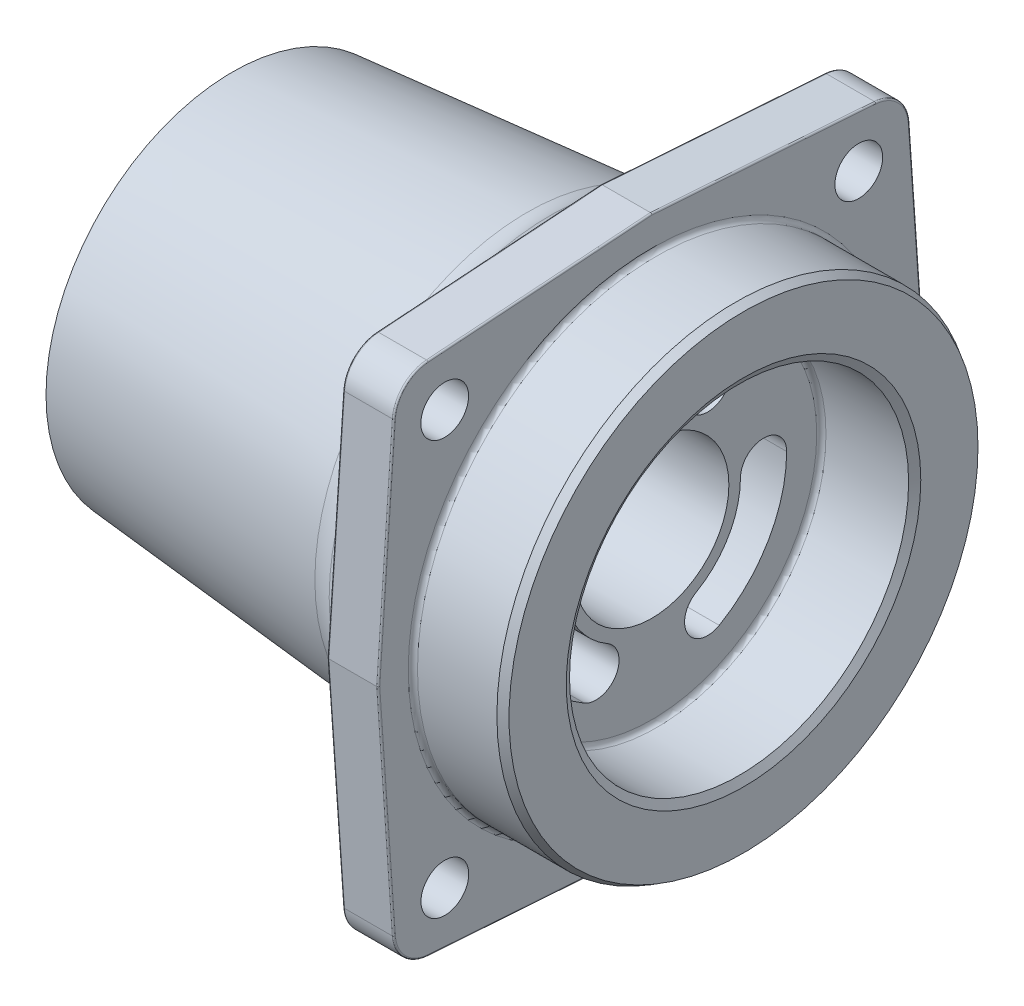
ISO-10303-21;
HEADER;
FILE_DESCRIPTION(('STEP AP214'),'2;1');
FILE_NAME('part.step','',(''),(''),'','','');
FILE_SCHEMA(('AUTOMOTIVE_DESIGN { 1 0 10303 214 1 1 1 1 }'));
ENDSEC;
DATA;
#1=APPLICATION_CONTEXT('core data for automotive mechanical design processes');
#2=APPLICATION_PROTOCOL_DEFINITION('international standard','automotive_design',2000,#1);
#3=PRODUCT_CONTEXT('',#1,'mechanical');
#4=PRODUCT('Part','Part','',(#3));
#5=PRODUCT_RELATED_PRODUCT_CATEGORY('part','',(#4));
#6=PRODUCT_DEFINITION_FORMATION('','',#4);
#7=PRODUCT_DEFINITION_CONTEXT('part definition',#1,'design');
#8=PRODUCT_DEFINITION('design','',#6,#7);
#9=PRODUCT_DEFINITION_SHAPE('','',#8);
#10=(LENGTH_UNIT() NAMED_UNIT(*) SI_UNIT(.MILLI.,.METRE.));
#11=(NAMED_UNIT(*) PLANE_ANGLE_UNIT() SI_UNIT($,.RADIAN.));
#12=(NAMED_UNIT(*) SI_UNIT($,.STERADIAN.) SOLID_ANGLE_UNIT());
#13=UNCERTAINTY_MEASURE_WITH_UNIT(LENGTH_MEASURE(1.E-05),#10,'distance_accuracy_value','');
#14=(GEOMETRIC_REPRESENTATION_CONTEXT(3) GLOBAL_UNCERTAINTY_ASSIGNED_CONTEXT((#13)) GLOBAL_UNIT_ASSIGNED_CONTEXT((#10,
#11,#12)) REPRESENTATION_CONTEXT('',''));
#15=CARTESIAN_POINT('',(0.,0.,0.));
#16=DIRECTION('',(0.,0.,1.));
#17=DIRECTION('',(1.,0.,0.));
#18=AXIS2_PLACEMENT_3D('',#15,#16,#17);
#19=CARTESIAN_POINT('',(-3.3,14.3609154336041,14.3599752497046));
#20=DIRECTION('',(-1.,0.,0.));
#21=DIRECTION('',(0.,0.,1.));
#22=AXIS2_PLACEMENT_3D('',#19,#20,#21);
#23=PLANE('',#22);
#24=DIRECTION('',(0.,-0.997568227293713,-0.0696967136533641));
#25=VECTOR('',#24,1.);
#26=CARTESIAN_POINT('',(-3.3,-0.00696967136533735,-17.6502431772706));
#27=LINE('',#26,#25);
#28=CARTESIAN_POINT('',(-3.3,14.5188837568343,-16.6353709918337));
#29=VERTEX_POINT('',#28);
#30=CARTESIAN_POINT('',(-3.3,3.00260262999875E-06,-17.6497560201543));
#31=VERTEX_POINT('',#30);
#32=EDGE_CURVE('E828',#29,#31,#27,.T.);
#33=ORIENTED_EDGE('',*,*,#32,.T.);
#34=DIRECTION('',(0.,-0.997564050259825,0.0697564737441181));
#35=VECTOR('',#34,1.);
#36=CARTESIAN_POINT('',(-3.3,-14.5199601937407,-16.634421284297));
#37=LINE('',#36,#35);
#38=CARTESIAN_POINT('',(-3.3,-14.5199601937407,-16.634421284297));
#39=VERTEX_POINT('',#38);
#40=EDGE_CURVE('E832',#31,#39,#37,.T.);
#41=ORIENTED_EDGE('',*,*,#40,.T.);
#42=CARTESIAN_POINT('',(-3.3,-14.3609154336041,-14.3599752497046));
#43=DIRECTION('',(-1.,0.,0.));
#44=DIRECTION('',(0.,0.,1.));
#45=AXIS2_PLACEMENT_3D('',#42,#43,#44);
#46=CIRCLE('',#45,2.28);
#47=CARTESIAN_POINT('',(-3.3,-16.6353709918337,-14.5188837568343));
#48=VERTEX_POINT('',#47);
#49=EDGE_CURVE('E830',#39,#48,#46,.T.);
#50=ORIENTED_EDGE('',*,*,#49,.T.);
#51=DIRECTION('',(0.,-0.0696967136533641,0.997568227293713));
#52=VECTOR('',#51,1.);
#53=CARTESIAN_POINT('',(-3.3,-17.6502431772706,0.00696967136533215));
#54=LINE('',#53,#52);
#55=CARTESIAN_POINT('',(-3.3,-17.6497560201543,-3.00260255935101E-06));
#56=VERTEX_POINT('',#55);
#57=EDGE_CURVE('E821',#48,#56,#54,.T.);
#58=ORIENTED_EDGE('',*,*,#57,.T.);
#59=DIRECTION('',(0.,0.0697564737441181,0.997564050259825));
#60=VECTOR('',#59,1.);
#61=CARTESIAN_POINT('',(-3.3,-16.634421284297,14.5199601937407));
#62=LINE('',#61,#60);
#63=CARTESIAN_POINT('',(-3.3,-16.634421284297,14.5199601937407));
#64=VERTEX_POINT('',#63);
#65=EDGE_CURVE('E819',#56,#64,#62,.T.);
#66=ORIENTED_EDGE('',*,*,#65,.T.);
#67=CARTESIAN_POINT('',(-3.3,-14.3599752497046,14.3609154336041));
#68=DIRECTION('',(-1.,0.,0.));
#69=DIRECTION('',(0.,0.,1.));
#70=AXIS2_PLACEMENT_3D('',#67,#68,#69);
#71=CIRCLE('',#70,2.28);
#72=CARTESIAN_POINT('',(-3.3,-14.5188837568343,16.6353709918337));
#73=VERTEX_POINT('',#72);
#74=EDGE_CURVE('E817',#64,#73,#71,.T.);
#75=ORIENTED_EDGE('',*,*,#74,.T.);
#76=DIRECTION('',(0.,0.997568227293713,0.0696967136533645));
#77=VECTOR('',#76,1.);
#78=CARTESIAN_POINT('',(-3.3,0.00696967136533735,17.6502431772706));
#79=LINE('',#78,#77);
#80=CARTESIAN_POINT('',(-3.3,-3.0026026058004E-06,17.6497560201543));
#81=VERTEX_POINT('',#80);
#82=EDGE_CURVE('E811',#73,#81,#79,.T.);
#83=ORIENTED_EDGE('',*,*,#82,.T.);
#84=DIRECTION('',(0.,0.997564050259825,-0.0697564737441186));
#85=VECTOR('',#84,1.);
#86=CARTESIAN_POINT('',(-3.3,14.5199601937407,16.634421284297));
#87=LINE('',#86,#85);
#88=CARTESIAN_POINT('',(-3.3,14.5199601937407,16.634421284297));
#89=VERTEX_POINT('',#88);
#90=EDGE_CURVE('E809',#81,#89,#87,.T.);
#91=ORIENTED_EDGE('',*,*,#90,.T.);
#92=CARTESIAN_POINT('',(-3.3,14.3609154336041,14.3599752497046));
#93=DIRECTION('',(-1.,0.,0.));
#94=DIRECTION('',(0.,0.,1.));
#95=AXIS2_PLACEMENT_3D('',#92,#93,#94);
#96=CIRCLE('',#95,2.28);
#97=CARTESIAN_POINT('',(-3.3,16.6353709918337,14.5188837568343));
#98=VERTEX_POINT('',#97);
#99=EDGE_CURVE('E813',#89,#98,#96,.T.);
#100=ORIENTED_EDGE('',*,*,#99,.T.);
#101=DIRECTION('',(0.,0.0696967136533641,-0.997568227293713));
#102=VECTOR('',#101,1.);
#103=CARTESIAN_POINT('',(-3.3,17.6502431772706,-0.00696967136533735));
#104=LINE('',#103,#102);
#105=CARTESIAN_POINT('',(-3.3,17.6497560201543,3.00260257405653E-06));
#106=VERTEX_POINT('',#105);
#107=EDGE_CURVE('E815',#98,#106,#104,.T.);
#108=ORIENTED_EDGE('',*,*,#107,.T.);
#109=DIRECTION('',(0.,-0.0697564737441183,-0.997564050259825));
#110=VECTOR('',#109,1.);
#111=CARTESIAN_POINT('',(-3.3,16.634421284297,-14.5199601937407));
#112=LINE('',#111,#110);
#113=CARTESIAN_POINT('',(-3.3,16.634421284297,-14.5199601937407));
#114=VERTEX_POINT('',#113);
#115=EDGE_CURVE('E824',#106,#114,#112,.T.);
#116=ORIENTED_EDGE('',*,*,#115,.T.);
#117=CARTESIAN_POINT('',(-3.3,14.3599752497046,-14.3609154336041));
#118=DIRECTION('',(-1.,0.,0.));
#119=DIRECTION('',(0.,0.,1.));
#120=AXIS2_PLACEMENT_3D('',#117,#118,#119);
#121=CIRCLE('',#120,2.28);
#122=EDGE_CURVE('E826',#114,#29,#121,.T.);
#123=ORIENTED_EDGE('',*,*,#122,.T.);
#124=EDGE_LOOP('',(#33,#41,#50,#58,#66,#75,#83,#91,#100,#108,#116,#123));
#125=FACE_BOUND('',#124,.T.);
#126=CARTESIAN_POINT('',(-3.3,0.,0.));
#127=DIRECTION('',(-1.,0.,0.));
#128=DIRECTION('',(0.,0.,1.));
#129=AXIS2_PLACEMENT_3D('',#126,#127,#128);
#130=CIRCLE('',#129,17.1530952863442);
#131=CARTESIAN_POINT('',(-3.29999999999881,-13.6160261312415,10.4322821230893));
#132=VERTEX_POINT('',#131);
#133=CARTESIAN_POINT('',(-3.3,-13.6100050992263,-10.4401359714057));
#134=VERTEX_POINT('',#133);
#135=EDGE_CURVE('E674',#132,#134,#130,.F.);
#136=ORIENTED_EDGE('',*,*,#135,.T.);
#137=CARTESIAN_POINT('',(-3.3,-13.4350288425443,-13.4350288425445));
#138=DIRECTION('',(-1.,0.,0.));
#139=DIRECTION('',(0.,0.,1.));
#140=AXIS2_PLACEMENT_3D('',#137,#138,#139);
#141=CIRCLE('',#140,3.);
#142=CARTESIAN_POINT('',(-3.3,-10.4401359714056,-13.6100050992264));
#143=VERTEX_POINT('',#142);
#144=EDGE_CURVE('E439',#134,#143,#141,.F.);
#145=ORIENTED_EDGE('',*,*,#144,.T.);
#146=CARTESIAN_POINT('',(-3.3,10.4313899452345,-13.6167096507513));
#147=VERTEX_POINT('',#146);
#148=EDGE_CURVE('E637',#143,#147,#130,.F.);
#149=ORIENTED_EDGE('',*,*,#148,.T.);
#150=CARTESIAN_POINT('',(-3.3,13.425335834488,-13.4262155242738));
#151=DIRECTION('',(-1.,0.,0.));
#152=DIRECTION('',(0.,0.,1.));
#153=AXIS2_PLACEMENT_3D('',#150,#151,#152);
#154=CIRCLE('',#153,3.);
#155=CARTESIAN_POINT('',(-3.3,13.6160261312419,-10.43228212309));
#156=VERTEX_POINT('',#155);
#157=EDGE_CURVE('E583',#147,#156,#154,.F.);
#158=ORIENTED_EDGE('',*,*,#157,.T.);
#159=CARTESIAN_POINT('',(-3.3,13.6100050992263,10.4401359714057));
#160=VERTEX_POINT('',#159);
#161=EDGE_CURVE('E638',#156,#160,#130,.F.);
#162=ORIENTED_EDGE('',*,*,#161,.T.);
#163=CARTESIAN_POINT('',(-3.3,13.4350288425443,13.4350288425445));
#164=DIRECTION('',(-1.,0.,0.));
#165=DIRECTION('',(0.,0.,1.));
#166=AXIS2_PLACEMENT_3D('',#163,#164,#165);
#167=CIRCLE('',#166,3.);
#168=CARTESIAN_POINT('',(-3.29999999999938,10.4401359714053,13.6100050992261));
#169=VERTEX_POINT('',#168);
#170=EDGE_CURVE('E555',#160,#169,#167,.F.);
#171=ORIENTED_EDGE('',*,*,#170,.T.);
#172=CARTESIAN_POINT('',(-3.3,-10.4313899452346,13.6167096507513));
#173=VERTEX_POINT('',#172);
#174=EDGE_CURVE('E642',#169,#173,#130,.F.);
#175=ORIENTED_EDGE('',*,*,#174,.T.);
#176=CARTESIAN_POINT('',(-3.3,-13.4253358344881,13.4262155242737));
#177=DIRECTION('',(-1.,0.,0.));
#178=DIRECTION('',(0.,0.,1.));
#179=AXIS2_PLACEMENT_3D('',#176,#177,#178);
#180=CIRCLE('',#179,3.);
#181=EDGE_CURVE('E540',#173,#132,#180,.F.);
#182=ORIENTED_EDGE('',*,*,#181,.T.);
#183=EDGE_LOOP('',(#136,#145,#149,#158,#162,#171,#175,#182));
#184=FACE_BOUND('',#183,.T.);
#185=ADVANCED_FACE('F35',(#125,#184),#23,.T.);
#186=CARTESIAN_POINT('',(-7.28477879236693,0.,0.));
#187=DIRECTION('',(1.,0.,0.));
#188=DIRECTION('',(0.,0.,-1.));
#189=AXIS2_PLACEMENT_3D('',#186,#187,#188);
#190=CONICAL_SURFACE('',#189,13.842356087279,0.61086523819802);
#191=CARTESIAN_POINT('',(-6.62630540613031,0.,0.));
#192=DIRECTION('',(-1.,0.,0.));
#193=DIRECTION('',(0.,0.,1.));
#194=AXIS2_PLACEMENT_3D('',#191,#192,#193);
#195=CIRCLE('',#194,14.3034241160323);
#196=CARTESIAN_POINT('',(-6.62630540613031,0.,14.3034241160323));
#197=VERTEX_POINT('',#196);
#198=EDGE_CURVE('E649',#197,#197,#195,.F.);
#199=ORIENTED_EDGE('',*,*,#198,.T.);
#200=EDGE_LOOP('',(#199));
#201=FACE_BOUND('',#200,.T.);
#202=CARTESIAN_POINT('',(-3.72622356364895,-12.4160539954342,-10.6133821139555));
#203=CARTESIAN_POINT('',(-3.78657615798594,-12.3356048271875,-10.6424460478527));
#204=CARTESIAN_POINT('',(-3.84365689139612,-12.2537888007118,-10.675876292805));
#205=CARTESIAN_POINT('',(-3.94895103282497,-12.0876501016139,-10.7530336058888));
#206=CARTESIAN_POINT('',(-3.99703908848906,-12.0033086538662,-10.796889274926));
#207=CARTESIAN_POINT('',(-4.08059051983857,-11.8339038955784,-10.8961180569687));
#208=CARTESIAN_POINT('',(-4.11596028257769,-11.748839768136,-10.9515720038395));
#209=CARTESIAN_POINT('',(-4.16971471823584,-11.5818975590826,-11.0735695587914));
#210=CARTESIAN_POINT('',(-4.1881952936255,-11.5000040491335,-11.1400479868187));
#211=CARTESIAN_POINT('',(-4.20517465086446,-11.3500910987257,-11.2757981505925));
#212=CARTESIAN_POINT('',(-4.20539710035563,-11.2814919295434,-11.3442118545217));
#213=CARTESIAN_POINT('',(-4.19013826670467,-11.1519816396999,-11.4864496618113));
#214=CARTESIAN_POINT('',(-4.17463957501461,-11.0910791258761,-11.5602796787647));
#215=CARTESIAN_POINT('',(-4.13186511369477,-10.9839190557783,-11.7031892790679));
#216=CARTESIAN_POINT('',(-4.10587853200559,-10.9368137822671,-11.7720343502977));
#217=CARTESIAN_POINT('',(-4.04444476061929,-10.8501408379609,-11.9102242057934));
#218=CARTESIAN_POINT('',(-4.00898538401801,-10.8105829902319,-11.9795695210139));
#219=CARTESIAN_POINT('',(-3.89917261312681,-10.7099338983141,-12.1727238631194));
#220=CARTESIAN_POINT('',(-3.81630422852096,-10.6567122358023,-12.2960209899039));
#221=CARTESIAN_POINT('',(-3.72622356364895,-10.6133821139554,-12.4160539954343));
#222=B_SPLINE_CURVE_WITH_KNOTS('',3,(#202,#203,#204,#205,#206,#207,#208,#209,#210,#211,#212,
#213,#214,#215,#216,#217,#218,#219,#220,#221),.UNSPECIFIED.,.F.,.F.,(4,2,2,2,2,2,2,2,2,4),(0.,
0.314486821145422,0.633075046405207,0.953962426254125,1.27301616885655,1.56191112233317,
1.85112632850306,2.11226840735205,2.37374808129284,2.84302241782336),.UNSPECIFIED.);
#223=CARTESIAN_POINT('',(-3.72642356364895,-12.4157874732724,-10.6134783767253));
#224=VERTEX_POINT('',#223);
#225=CARTESIAN_POINT('',(-3.72642356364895,-10.6134783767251,-12.4157874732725));
#226=VERTEX_POINT('',#225);
#227=EDGE_CURVE('E432',#224,#226,#222,.T.);
#228=ORIENTED_EDGE('',*,*,#227,.F.);
#229=CARTESIAN_POINT('',(-3.72642356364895,0.,0.));
#230=DIRECTION('',(-1.,0.,0.));
#231=DIRECTION('',(0.,0.,1.));
#232=AXIS2_PLACEMENT_3D('',#229,#230,#231);
#233=CIRCLE('',#232,16.3339432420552);
#234=CARTESIAN_POINT('',(-3.72642356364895,-12.4308351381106,10.5958501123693));
#235=VERTEX_POINT('',#234);
#236=EDGE_CURVE('E647',#224,#235,#233,.T.);
#237=ORIENTED_EDGE('',*,*,#236,.T.);
#238=CARTESIAN_POINT('',(-3.72622356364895,-10.5949432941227,12.4317920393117));
#239=CARTESIAN_POINT('',(-3.78798063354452,-10.6234655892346,12.3506556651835));
#240=CARTESIAN_POINT('',(-3.84650696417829,-10.6563789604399,12.268105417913));
#241=CARTESIAN_POINT('',(-3.95477361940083,-10.7326342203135,12.1003189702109));
#242=CARTESIAN_POINT('',(-4.00438437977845,-10.77611115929,12.0150615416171));
#243=CARTESIAN_POINT('',(-4.09096874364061,-10.8747885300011,11.8436475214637));
#244=CARTESIAN_POINT('',(-4.12784810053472,-10.930071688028,11.7574888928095));
#245=CARTESIAN_POINT('',(-4.184431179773,-11.0520431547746,11.5882121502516));
#246=CARTESIAN_POINT('',(-4.20423438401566,-11.1186626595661,11.5050791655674));
#247=CARTESIAN_POINT('',(-4.22334657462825,-11.2548592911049,11.3529511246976));
#248=CARTESIAN_POINT('',(-4.22445755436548,-11.3235223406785,11.2833669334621));
#249=CARTESIAN_POINT('',(-4.21063729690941,-11.4664976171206,11.1519261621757));
#250=CARTESIAN_POINT('',(-4.19568993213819,-11.5408154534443,11.0900774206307));
#251=CARTESIAN_POINT('',(-4.15384944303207,-11.6840681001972,10.9817935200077));
#252=CARTESIAN_POINT('',(-4.12839764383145,-11.7527335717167,10.9344183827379));
#253=CARTESIAN_POINT('',(-4.0679287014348,-11.8906954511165,10.8471552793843));
#254=CARTESIAN_POINT('',(-4.03289706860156,-11.9599926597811,10.8072788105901));
#255=CARTESIAN_POINT('',(-3.95567967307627,-12.0971729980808,10.7351310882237));
#256=CARTESIAN_POINT('',(-3.91358153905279,-12.1650632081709,10.7027770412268));
#257=CARTESIAN_POINT('',(-3.82376034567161,-12.2992783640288,10.6446173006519));
#258=CARTESIAN_POINT('',(-3.77607298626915,-12.365610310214,10.6187730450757));
#259=CARTESIAN_POINT('',(-3.72622356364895,-12.4310978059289,10.5957578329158));
#260=B_SPLINE_CURVE_WITH_KNOTS('',3,(#238,#239,#240,#241,#242,#243,#244,#245,#246,#247,#248,
#249,#250,#251,#252,#253,#254,#255,#256,#257,#258,#259),.UNSPECIFIED.,.F.,.F.,(4,2,2,2,2,2,2,2,
2,2,4),(0.,0.318077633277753,0.64045811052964,0.965176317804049,1.2879897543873,
1.57948287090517,1.87126901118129,2.13198831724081,2.39310416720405,2.65119346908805,
2.90771593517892),.UNSPECIFIED.);
#261=CARTESIAN_POINT('',(-3.72642356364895,-10.5950355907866,12.4315293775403));
#262=VERTEX_POINT('',#261);
#263=EDGE_CURVE('E534',#262,#235,#260,.T.);
#264=ORIENTED_EDGE('',*,*,#263,.F.);
#265=CARTESIAN_POINT('',(-3.72642356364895,10.6134783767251,12.4157874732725));
#266=VERTEX_POINT('',#265);
#267=EDGE_CURVE('E688',#262,#266,#233,.T.);
#268=ORIENTED_EDGE('',*,*,#267,.T.);
#269=CARTESIAN_POINT('',(-3.72622356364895,12.4160539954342,10.6133821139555));
#270=CARTESIAN_POINT('',(-3.78657615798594,12.3356048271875,10.6424460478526));
#271=CARTESIAN_POINT('',(-3.84365689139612,12.2537888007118,10.675876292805));
#272=CARTESIAN_POINT('',(-3.94895103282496,12.0876501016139,10.7530336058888));
#273=CARTESIAN_POINT('',(-3.99703908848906,12.0033086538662,10.796889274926));
#274=CARTESIAN_POINT('',(-4.08059051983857,11.8339038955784,10.8961180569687));
#275=CARTESIAN_POINT('',(-4.1159602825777,11.748839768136,10.9515720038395));
#276=CARTESIAN_POINT('',(-4.16971471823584,11.5818975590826,11.0735695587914));
#277=CARTESIAN_POINT('',(-4.18819529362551,11.5000040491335,11.1400479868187));
#278=CARTESIAN_POINT('',(-4.20517465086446,11.3500910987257,11.2757981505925));
#279=CARTESIAN_POINT('',(-4.20539710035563,11.2814919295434,11.3442118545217));
#280=CARTESIAN_POINT('',(-4.19013826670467,11.1519816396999,11.4864496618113));
#281=CARTESIAN_POINT('',(-4.17463957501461,11.0910791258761,11.5602796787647));
#282=CARTESIAN_POINT('',(-4.13186511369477,10.9839190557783,11.7031892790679));
#283=CARTESIAN_POINT('',(-4.1058785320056,10.9368137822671,11.7720343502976));
#284=CARTESIAN_POINT('',(-4.0444447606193,10.8501408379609,11.9102242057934));
#285=CARTESIAN_POINT('',(-4.00898538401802,10.8105829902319,11.9795695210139));
#286=CARTESIAN_POINT('',(-3.89917261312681,10.7099338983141,12.1727238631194));
#287=CARTESIAN_POINT('',(-3.81630422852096,10.6567122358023,12.2960209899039));
#288=CARTESIAN_POINT('',(-3.72622356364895,10.6133821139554,12.4160539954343));
#289=B_SPLINE_CURVE_WITH_KNOTS('',3,(#269,#270,#271,#272,#273,#274,#275,#276,#277,#278,#279,
#280,#281,#282,#283,#284,#285,#286,#287,#288),.UNSPECIFIED.,.F.,.F.,(4,2,2,2,2,2,2,2,2,4),(0.,
0.31448682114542,0.633075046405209,0.953962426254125,1.27301616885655,1.56191112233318,
1.85112632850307,2.11226840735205,2.37374808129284,2.84302241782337),.UNSPECIFIED.);
#290=CARTESIAN_POINT('',(-3.72642356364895,12.4157874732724,10.6134783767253));
#291=VERTEX_POINT('',#290);
#292=EDGE_CURVE('E549',#291,#266,#289,.T.);
#293=ORIENTED_EDGE('',*,*,#292,.F.);
#294=CARTESIAN_POINT('',(-3.72642356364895,12.4308351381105,-10.5958501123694));
#295=VERTEX_POINT('',#294);
#296=EDGE_CURVE('E641',#291,#295,#233,.T.);
#297=ORIENTED_EDGE('',*,*,#296,.T.);
#298=CARTESIAN_POINT('',(-3.72622356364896,10.5949432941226,-12.4317920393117));
#299=CARTESIAN_POINT('',(-3.78798063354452,10.6234655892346,-12.3506556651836));
#300=CARTESIAN_POINT('',(-3.84650696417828,10.6563789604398,-12.2681054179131));
#301=CARTESIAN_POINT('',(-3.95477361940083,10.7326342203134,-12.100318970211));
#302=CARTESIAN_POINT('',(-4.00438437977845,10.7761111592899,-12.0150615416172));
#303=CARTESIAN_POINT('',(-4.09096874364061,10.874788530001,-11.8436475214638));
#304=CARTESIAN_POINT('',(-4.12784810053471,10.9300716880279,-11.7574888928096));
#305=CARTESIAN_POINT('',(-4.18443117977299,11.0520431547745,-11.5882121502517));
#306=CARTESIAN_POINT('',(-4.20423438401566,11.118662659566,-11.5050791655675));
#307=CARTESIAN_POINT('',(-4.22334657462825,11.2548592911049,-11.3529511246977));
#308=CARTESIAN_POINT('',(-4.22445755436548,11.3235223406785,-11.2833669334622));
#309=CARTESIAN_POINT('',(-4.2106372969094,11.4664976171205,-11.1519261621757));
#310=CARTESIAN_POINT('',(-4.19568993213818,11.5408154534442,-11.0900774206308));
#311=CARTESIAN_POINT('',(-4.15384944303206,11.6840681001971,-10.9817935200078));
#312=CARTESIAN_POINT('',(-4.12839764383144,11.7527335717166,-10.934418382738));
#313=CARTESIAN_POINT('',(-4.06792870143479,11.8906954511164,-10.8471552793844));
#314=CARTESIAN_POINT('',(-4.03289706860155,11.959992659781,-10.8072788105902));
#315=CARTESIAN_POINT('',(-3.95567967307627,12.0971729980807,-10.7351310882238));
#316=CARTESIAN_POINT('',(-3.91358153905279,12.1650632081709,-10.7027770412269));
#317=CARTESIAN_POINT('',(-3.82376034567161,12.2992783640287,-10.644617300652));
#318=CARTESIAN_POINT('',(-3.77607298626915,12.3656103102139,-10.6187730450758));
#319=CARTESIAN_POINT('',(-3.72622356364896,12.4310978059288,-10.5957578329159));
#320=B_SPLINE_CURVE_WITH_KNOTS('',3,(#298,#299,#300,#301,#302,#303,#304,#305,#306,#307,#308,
#309,#310,#311,#312,#313,#314,#315,#316,#317,#318,#319),.UNSPECIFIED.,.F.,.F.,(4,2,2,2,2,2,2,2,
2,2,4),(0.,0.318077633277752,0.640458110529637,0.965176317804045,1.28798975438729,
1.57948287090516,1.87126901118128,2.13198831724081,2.39310416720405,2.65119346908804,
2.90771593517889),.UNSPECIFIED.);
#321=CARTESIAN_POINT('',(-3.72642356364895,10.5950355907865,-12.4315293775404));
#322=VERTEX_POINT('',#321);
#323=EDGE_CURVE('E577',#322,#295,#320,.T.);
#324=ORIENTED_EDGE('',*,*,#323,.F.);
#325=EDGE_CURVE('E643',#322,#226,#233,.T.);
#326=ORIENTED_EDGE('',*,*,#325,.T.);
#327=EDGE_LOOP('',(#228,#237,#264,#268,#293,#297,#324,#326));
#328=FACE_BOUND('',#327,.T.);
#329=ADVANCED_FACE('F441',(#201,#328),#190,.T.);
#330=CARTESIAN_POINT('',(-4.3,0.,0.));
#331=DIRECTION('',(-1.,0.,0.));
#332=DIRECTION('',(0.,0.,1.));
#333=AXIS2_PLACEMENT_3D('',#330,#331,#332);
#334=TOROIDAL_SURFACE('',#333,17.1530952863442,1.);
#335=CARTESIAN_POINT('',(-3.72662356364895,-10.6135746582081,-12.4155209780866));
#336=CARTESIAN_POINT('',(-3.70945527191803,-10.605305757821,-12.4384025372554));
#337=CARTESIAN_POINT('',(-3.69276251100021,-10.5972049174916,-12.4616947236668));
#338=CARTESIAN_POINT('',(-3.66029499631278,-10.5814050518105,-12.5090412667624));
#339=CARTESIAN_POINT('',(-3.64452019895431,-10.5737060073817,-12.5330955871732));
#340=CARTESIAN_POINT('',(-3.59848389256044,-10.5512909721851,-12.6063752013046));
#341=CARTESIAN_POINT('',(-3.56955162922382,-10.5372772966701,-12.6566617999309));
#342=CARTESIAN_POINT('',(-3.51502380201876,-10.5114071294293,-12.7602566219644));
#343=CARTESIAN_POINT('',(-3.48946650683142,-10.4995748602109,-12.8135910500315));
#344=CARTESIAN_POINT('',(-3.44239835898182,-10.4786159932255,-12.9224890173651));
#345=CARTESIAN_POINT('',(-3.42088488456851,-10.4694876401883,-12.9780510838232));
#346=CARTESIAN_POINT('',(-3.37459869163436,-10.451163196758,-13.1141314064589));
#347=CARTESIAN_POINT('',(-3.35204264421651,-10.4434410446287,-13.1956321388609));
#348=CARTESIAN_POINT('',(-3.31812957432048,-10.4348045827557,-13.3610750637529));
#349=CARTESIAN_POINT('',(-3.30672952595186,-10.4338640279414,-13.4450065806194));
#350=CARTESIAN_POINT('',(-3.29859800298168,-10.4386066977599,-13.5960732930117));
#351=CARTESIAN_POINT('',(-3.29932779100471,-10.442964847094,-13.6631054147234));
#352=CARTESIAN_POINT('',(-3.31083010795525,-10.4560702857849,-13.7959256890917));
#353=CARTESIAN_POINT('',(-3.32159971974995,-10.4648162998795,-13.8617141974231));
#354=CARTESIAN_POINT('',(-3.35441218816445,-10.4861604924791,-13.9904237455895));
#355=CARTESIAN_POINT('',(-3.37654720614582,-10.498789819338,-14.0533166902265));
#356=CARTESIAN_POINT('',(-3.432542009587,-10.5265734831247,-14.173040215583));
#357=CARTESIAN_POINT('',(-3.46639116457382,-10.541725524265,-14.2298762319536));
#358=CARTESIAN_POINT('',(-3.53636017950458,-10.5692271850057,-14.3232892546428));
#359=CARTESIAN_POINT('',(-3.5702862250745,-10.5814473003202,-14.3615563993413));
#360=CARTESIAN_POINT('',(-3.62565766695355,-10.5993459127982,-14.4144424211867));
#361=CARTESIAN_POINT('',(-3.6448935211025,-10.6052485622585,-14.4313401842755));
#362=CARTESIAN_POINT('',(-3.68474880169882,-10.6167893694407,-14.4635317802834));
#363=CARTESIAN_POINT('',(-3.70536868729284,-10.6224274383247,-14.4788250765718));
#364=CARTESIAN_POINT('',(-3.72662356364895,-10.6278742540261,-14.4932741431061));
#365=B_SPLINE_CURVE_WITH_KNOTS('',3,(#335,#336,#337,#338,#339,#340,#341,#342,#343,#344,#345,
#346,#347,#348,#349,#350,#351,#352,#353,#354,#355,#356,#357,#358,#359,#360,#361,#362,#363,#364),
.UNSPECIFIED.,.F.,.F.,(4,2,2,2,2,2,2,2,2,2,2,2,2,2,4),(0.,0.0893153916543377,0.178626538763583,
0.357463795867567,0.538180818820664,0.718780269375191,0.972623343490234,1.22548350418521,
1.42623459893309,1.62692738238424,1.82927389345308,2.03143725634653,2.18846975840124,
2.26721826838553,2.34599303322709),.UNSPECIFIED.);
#366=EDGE_CURVE('E464',#226,#143,#365,.T.);
#367=ORIENTED_EDGE('',*,*,#366,.F.);
#368=ORIENTED_EDGE('',*,*,#325,.F.);
#369=CARTESIAN_POINT('',(-3.72662356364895,10.6229077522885,-14.496914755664));
#370=CARTESIAN_POINT('',(-3.7041553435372,10.6170899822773,-14.4816856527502));
#371=CARTESIAN_POINT('',(-3.68239654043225,10.6110546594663,-14.4655178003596));
#372=CARTESIAN_POINT('',(-3.64042651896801,10.5986863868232,-14.4313940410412));
#373=CARTESIAN_POINT('',(-3.62021504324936,10.5923534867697,-14.4134384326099));
#374=CARTESIAN_POINT('',(-3.56224780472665,10.5731658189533,-14.3571752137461));
#375=CARTESIAN_POINT('',(-3.52696698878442,10.5600705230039,-14.3163407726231));
#376=CARTESIAN_POINT('',(-3.46392888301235,10.53441779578,-14.2291210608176));
#377=CARTESIAN_POINT('',(-3.43617229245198,10.5218604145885,-14.1827352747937));
#378=CARTESIAN_POINT('',(-3.38849831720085,10.4983022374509,-14.0857341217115));
#379=CARTESIAN_POINT('',(-3.36858314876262,10.4873018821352,-14.0351175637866));
#380=CARTESIAN_POINT('',(-3.33593114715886,10.4673039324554,-13.9292535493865));
#381=CARTESIAN_POINT('',(-3.32347055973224,10.4583901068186,-13.8739059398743));
#382=CARTESIAN_POINT('',(-3.30628903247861,10.4436076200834,-13.7616460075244));
#383=CARTESIAN_POINT('',(-3.3015721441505,10.4377405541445,-13.7047328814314));
#384=CARTESIAN_POINT('',(-3.29858740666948,10.4275597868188,-13.5670644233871));
#385=CARTESIAN_POINT('',(-3.30376037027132,10.4248715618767,-13.4861092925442));
#386=CARTESIAN_POINT('',(-3.32552885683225,10.4259372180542,-13.3257563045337));
#387=CARTESIAN_POINT('',(-3.34215369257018,10.4297076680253,-13.246362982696));
#388=CARTESIAN_POINT('',(-3.39193479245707,10.4454308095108,-13.0641343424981));
#389=CARTESIAN_POINT('',(-3.42878928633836,10.4597289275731,-12.9625029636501));
#390=CARTESIAN_POINT('',(-3.49386278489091,10.487642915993,-12.8159246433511));
#391=CARTESIAN_POINT('',(-3.5171932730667,10.4980289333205,-12.7680316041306));
#392=CARTESIAN_POINT('',(-3.56694024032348,10.5206840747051,-12.6743433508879));
#393=CARTESIAN_POINT('',(-3.59335506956,10.5329521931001,-12.6285470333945));
#394=CARTESIAN_POINT('',(-3.63777946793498,10.5537106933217,-12.5575819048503));
#395=CARTESIAN_POINT('',(-3.6548060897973,10.5616929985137,-12.5316398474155));
#396=CARTESIAN_POINT('',(-3.68990965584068,10.5780976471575,-12.4807265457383));
#397=CARTESIAN_POINT('',(-3.7079837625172,10.5865187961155,-12.4557529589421));
#398=CARTESIAN_POINT('',(-3.72662356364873,10.5951279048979,-12.4312667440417));
#399=B_SPLINE_CURVE_WITH_KNOTS('',3,(#369,#370,#371,#372,#373,#374,#375,#376,#377,#378,#379,
#380,#381,#382,#383,#384,#385,#386,#387,#388,#389,#390,#391,#392,#393,#394,#395,#396,#397,#398),
.UNSPECIFIED.,.F.,.F.,(4,2,2,2,2,2,2,2,2,2,2,2,2,2,4),(0.,0.0832261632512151,0.166438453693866,
0.332158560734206,0.497894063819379,0.663676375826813,0.835272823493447,1.00695902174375,
1.24909975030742,1.49186258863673,1.81713577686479,1.97985726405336,2.14249210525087,
2.23858467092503,2.33442810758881),.UNSPECIFIED.);
#400=EDGE_CURVE('E485',#147,#322,#399,.T.);
#401=ORIENTED_EDGE('',*,*,#400,.F.);
#402=ORIENTED_EDGE('',*,*,#148,.F.);
#403=EDGE_LOOP('',(#367,#368,#401,#402));
#404=FACE_BOUND('',#403,.T.);
#405=ADVANCED_FACE('F478',(#404),#334,.F.);
#406=CARTESIAN_POINT('',(-3.72662356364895,-14.493274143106,-10.6278742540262));
#407=CARTESIAN_POINT('',(-3.70415232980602,-14.4779971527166,-10.6221157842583));
#408=CARTESIAN_POINT('',(-3.68239236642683,-14.4617792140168,-10.6161438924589));
#409=CARTESIAN_POINT('',(-3.64042363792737,-14.4275524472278,-10.6039109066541));
#410=CARTESIAN_POINT('',(-3.62021460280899,-14.4095439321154,-10.5976498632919));
#411=CARTESIAN_POINT('',(-3.5622622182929,-14.3531228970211,-10.5786908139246));
#412=CARTESIAN_POINT('',(-3.52699802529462,-14.3121817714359,-10.5657649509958));
#413=CARTESIAN_POINT('',(-3.46399916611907,-14.2247571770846,-10.5404826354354));
#414=CARTESIAN_POINT('',(-3.43626492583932,-14.1782733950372,-10.5281262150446));
#415=CARTESIAN_POINT('',(-3.38862844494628,-14.0810906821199,-10.5049949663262));
#416=CARTESIAN_POINT('',(-3.36872860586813,-14.0303904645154,-10.4942206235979));
#417=CARTESIAN_POINT('',(-3.3360672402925,-13.9243029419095,-10.4746872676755));
#418=CARTESIAN_POINT('',(-3.32359231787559,-13.8688121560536,-10.4660160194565));
#419=CARTESIAN_POINT('',(-3.30637132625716,-13.7562802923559,-10.4517376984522));
#420=CARTESIAN_POINT('',(-3.30162931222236,-13.6992384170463,-10.4461322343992));
#421=CARTESIAN_POINT('',(-3.29854782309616,-13.5608438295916,-10.4365687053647));
#422=CARTESIAN_POINT('',(-3.30371183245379,-13.4792927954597,-10.4342778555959));
#423=CARTESIAN_POINT('',(-3.32550449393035,-13.3177809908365,-10.436223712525));
#424=CARTESIAN_POINT('',(-3.34216274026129,-13.2378248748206,-10.4404773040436));
#425=CARTESIAN_POINT('',(-3.39221388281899,-13.0535705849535,-10.4574878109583));
#426=CARTESIAN_POINT('',(-3.42941981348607,-12.9505258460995,-10.4726960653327));
#427=CARTESIAN_POINT('',(-3.49506051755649,-12.8019152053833,-10.5021567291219));
#428=CARTESIAN_POINT('',(-3.51858758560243,-12.7533579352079,-10.5130891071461));
#429=CARTESIAN_POINT('',(-3.56872740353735,-12.6583623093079,-10.5368953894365));
#430=CARTESIAN_POINT('',(-3.59533851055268,-12.611922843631,-10.5497682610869));
#431=CARTESIAN_POINT('',(-3.63964932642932,-12.5406162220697,-10.5713304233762));
#432=CARTESIAN_POINT('',(-3.6563436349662,-12.5149508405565,-10.5794794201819));
#433=CARTESIAN_POINT('',(-3.69072359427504,-12.4645452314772,-10.5962146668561));
#434=CARTESIAN_POINT('',(-3.70840655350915,-12.4398027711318,-10.6047997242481));
#435=CARTESIAN_POINT('',(-3.72662356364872,-12.4155209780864,-10.6135746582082));
#436=B_SPLINE_CURVE_WITH_KNOTS('',3,(#406,#407,#408,#409,#410,#411,#412,#413,#414,#415,#416,
#417,#418,#419,#420,#421,#422,#423,#424,#425,#426,#427,#428,#429,#430,#431,#432,#433,#434,#435),
.UNSPECIFIED.,.F.,.F.,(4,2,2,2,2,2,2,2,2,2,2,2,2,2,4),(0.,0.0832751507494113,0.166535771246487,
0.332340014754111,0.498153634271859,0.664018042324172,0.835927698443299,1.00792747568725,
1.25180124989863,1.49630528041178,1.82621946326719,1.99127171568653,2.15623644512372,
2.25125860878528,2.34603360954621),.UNSPECIFIED.);
#437=EDGE_CURVE('E458',#134,#224,#436,.T.);
#438=ORIENTED_EDGE('',*,*,#437,.F.);
#439=ORIENTED_EDGE('',*,*,#135,.F.);
#440=CARTESIAN_POINT('',(-3.72662356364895,-12.430572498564,10.595942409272));
#441=CARTESIAN_POINT('',(-3.70963840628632,-12.4528821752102,10.5881003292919));
#442=CARTESIAN_POINT('',(-3.69312479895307,-12.4755984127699,10.5804134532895));
#443=CARTESIAN_POINT('',(-3.66100674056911,-12.5217829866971,10.5654148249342));
#444=CARTESIAN_POINT('',(-3.64540223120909,-12.5452512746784,10.5581030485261));
#445=CARTESIAN_POINT('',(-3.59986665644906,-12.6167466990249,10.5368111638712));
#446=CARTESIAN_POINT('',(-3.5712487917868,-12.6658176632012,10.5234911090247));
#447=CARTESIAN_POINT('',(-3.51729480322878,-12.7668952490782,10.4988976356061));
#448=CARTESIAN_POINT('',(-3.49199492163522,-12.8189266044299,10.4876463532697));
#449=CARTESIAN_POINT('',(-3.44532966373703,-12.925162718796,10.4677112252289));
#450=CARTESIAN_POINT('',(-3.42396202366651,-12.9793662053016,10.4590259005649));
#451=CARTESIAN_POINT('',(-3.37719806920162,-13.1139463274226,10.4413467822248));
#452=CARTESIAN_POINT('',(-3.35414736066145,-13.1953723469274,10.4338895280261));
#453=CARTESIAN_POINT('',(-3.31931814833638,-13.3607289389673,10.425776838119));
#454=CARTESIAN_POINT('',(-3.30749731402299,-13.4446488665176,10.4250957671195));
#455=CARTESIAN_POINT('',(-3.2986759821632,-13.5955768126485,10.4303049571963));
#456=CARTESIAN_POINT('',(-3.29910486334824,-13.6624728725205,10.4348582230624));
#457=CARTESIAN_POINT('',(-3.30999114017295,-13.7950516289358,10.4483409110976));
#458=CARTESIAN_POINT('',(-3.3204451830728,-13.8607347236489,10.457268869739));
#459=CARTESIAN_POINT('',(-3.35260100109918,-13.9892753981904,10.478970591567));
#460=CARTESIAN_POINT('',(-3.37439382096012,-14.0521055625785,10.4917751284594));
#461=CARTESIAN_POINT('',(-3.42968244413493,-14.1717737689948,10.5199110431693));
#462=CARTESIAN_POINT('',(-3.46316835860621,-14.228616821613,10.53524028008));
#463=CARTESIAN_POINT('',(-3.53311690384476,-14.3229643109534,10.5633199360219));
#464=CARTESIAN_POINT('',(-3.56752487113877,-14.3620352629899,10.5759465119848));
#465=CARTESIAN_POINT('',(-3.62380035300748,-14.4159690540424,10.5944299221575));
#466=CARTESIAN_POINT('',(-3.64337088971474,-14.4331918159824,10.600524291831));
#467=CARTESIAN_POINT('',(-3.68394896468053,-14.4659747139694,10.6124325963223));
#468=CARTESIAN_POINT('',(-3.70495697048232,-14.4815343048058,10.6182464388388));
#469=CARTESIAN_POINT('',(-3.72662356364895,-14.4962186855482,10.6238576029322));
#470=B_SPLINE_CURVE_WITH_KNOTS('',3,(#440,#441,#442,#443,#444,#445,#446,#447,#448,#449,#450,
#451,#452,#453,#454,#455,#456,#457,#458,#459,#460,#461,#462,#463,#464,#465,#466,#467,#468,#469),
.UNSPECIFIED.,.F.,.F.,(4,2,2,2,2,2,2,2,2,2,2,2,2,2,4),(0.,0.0873299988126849,0.17465439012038,
0.349485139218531,0.526089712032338,0.702592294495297,0.956533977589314,1.20951459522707,
1.40989037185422,1.61019915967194,1.81214173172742,2.01391393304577,2.17387563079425,
2.25411159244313,2.33437377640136),.UNSPECIFIED.);
#471=EDGE_CURVE('E516',#235,#132,#470,.T.);
#472=ORIENTED_EDGE('',*,*,#471,.F.);
#473=ORIENTED_EDGE('',*,*,#236,.F.);
#474=EDGE_LOOP('',(#438,#439,#472,#473));
#475=FACE_BOUND('',#474,.T.);
#476=ADVANCED_FACE('F677',(#475),#334,.F.);
#477=CARTESIAN_POINT('',(-3.3,-13.4350288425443,-13.4350288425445));
#478=DIRECTION('',(1.,0.,0.));
#479=DIRECTION('',(0.,0.,-1.));
#480=AXIS2_PLACEMENT_3D('',#477,#478,#479);
#481=CYLINDRICAL_SURFACE('',#480,1.55);
#482=CARTESIAN_POINT('',(0.,-13.4350288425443,-13.4350288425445));
#483=DIRECTION('',(-1.,0.,0.));
#484=DIRECTION('',(0.,0.,1.));
#485=AXIS2_PLACEMENT_3D('',#482,#483,#484);
#486=CIRCLE('',#485,1.55);
#487=CARTESIAN_POINT('',(0.,-13.4350288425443,-11.8850288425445));
#488=VERTEX_POINT('',#487);
#489=EDGE_CURVE('E591',#488,#488,#486,.T.);
#490=ORIENTED_EDGE('',*,*,#489,.F.);
#491=EDGE_LOOP('',(#490));
#492=FACE_BOUND('',#491,.T.);
#493=CARTESIAN_POINT('',(-2.8,-13.4350288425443,-13.4350288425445));
#494=DIRECTION('',(-1.,0.,0.));
#495=DIRECTION('',(0.,0.,1.));
#496=AXIS2_PLACEMENT_3D('',#493,#494,#495);
#497=CIRCLE('',#496,1.55);
#498=CARTESIAN_POINT('',(-2.8,-13.4350288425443,-11.8850288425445));
#499=VERTEX_POINT('',#498);
#500=EDGE_CURVE('E431',#499,#499,#497,.T.);
#501=ORIENTED_EDGE('',*,*,#500,.T.);
#502=EDGE_LOOP('',(#501));
#503=FACE_BOUND('',#502,.T.);
#504=ADVANCED_FACE('F690',(#492,#503),#481,.F.);
#505=CARTESIAN_POINT('',(-3.72662356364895,-10.6229077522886,14.4969147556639));
#506=CARTESIAN_POINT('',(-3.7041553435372,-10.6170899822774,14.4816856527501));
#507=CARTESIAN_POINT('',(-3.68239654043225,-10.6110546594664,14.4655178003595));
#508=CARTESIAN_POINT('',(-3.64042651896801,-10.5986863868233,14.4313940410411));
#509=CARTESIAN_POINT('',(-3.62021504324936,-10.5923534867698,14.4134384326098));
#510=CARTESIAN_POINT('',(-3.56224780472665,-10.5731658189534,14.357175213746));
#511=CARTESIAN_POINT('',(-3.52696698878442,-10.560070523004,14.3163407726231));
#512=CARTESIAN_POINT('',(-3.46392888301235,-10.5344177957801,14.2291210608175));
#513=CARTESIAN_POINT('',(-3.43617229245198,-10.5218604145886,14.1827352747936));
#514=CARTESIAN_POINT('',(-3.38849831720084,-10.498302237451,14.0857341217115));
#515=CARTESIAN_POINT('',(-3.36858314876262,-10.4873018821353,14.0351175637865));
#516=CARTESIAN_POINT('',(-3.33593114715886,-10.4673039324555,13.9292535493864));
#517=CARTESIAN_POINT('',(-3.32347055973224,-10.4583901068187,13.8739059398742));
#518=CARTESIAN_POINT('',(-3.30628903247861,-10.4436076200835,13.7616460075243));
#519=CARTESIAN_POINT('',(-3.3015721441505,-10.4377405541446,13.7047328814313));
#520=CARTESIAN_POINT('',(-3.29858740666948,-10.4275597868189,13.567064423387));
#521=CARTESIAN_POINT('',(-3.30376037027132,-10.4248715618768,13.4861092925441));
#522=CARTESIAN_POINT('',(-3.32552885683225,-10.4259372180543,13.3257563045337));
#523=CARTESIAN_POINT('',(-3.34215369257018,-10.4297076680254,13.246362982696));
#524=CARTESIAN_POINT('',(-3.39193479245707,-10.4454308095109,13.064134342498));
#525=CARTESIAN_POINT('',(-3.42878928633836,-10.4597289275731,12.9625029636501));
#526=CARTESIAN_POINT('',(-3.49386278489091,-10.4876429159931,12.8159246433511));
#527=CARTESIAN_POINT('',(-3.5171932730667,-10.4980289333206,12.7680316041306));
#528=CARTESIAN_POINT('',(-3.56694024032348,-10.5206840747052,12.6743433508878));
#529=CARTESIAN_POINT('',(-3.59335506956,-10.5329521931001,12.6285470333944));
#530=CARTESIAN_POINT('',(-3.63777946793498,-10.5537106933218,12.5575819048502));
#531=CARTESIAN_POINT('',(-3.6548060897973,-10.5616929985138,12.5316398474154));
#532=CARTESIAN_POINT('',(-3.68990965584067,-10.5780976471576,12.4807265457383));
#533=CARTESIAN_POINT('',(-3.7079837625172,-10.5865187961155,12.455752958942));
#534=CARTESIAN_POINT('',(-3.72662356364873,-10.5951279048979,12.4312667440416));
#535=B_SPLINE_CURVE_WITH_KNOTS('',3,(#505,#506,#507,#508,#509,#510,#511,#512,#513,#514,#515,
#516,#517,#518,#519,#520,#521,#522,#523,#524,#525,#526,#527,#528,#529,#530,#531,#532,#533,#534),
.UNSPECIFIED.,.F.,.F.,(4,2,2,2,2,2,2,2,2,2,2,2,2,2,4),(0.,0.0832261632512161,0.166438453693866,
0.332158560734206,0.49789406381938,0.663676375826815,0.83527282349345,1.00695902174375,
1.24909975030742,1.49186258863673,1.81713577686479,1.97985726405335,2.14249210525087,
2.23858467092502,2.3344281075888),.UNSPECIFIED.);
#536=EDGE_CURVE('E521',#173,#262,#535,.T.);
#537=ORIENTED_EDGE('',*,*,#536,.F.);
#538=ORIENTED_EDGE('',*,*,#174,.F.);
#539=CARTESIAN_POINT('',(-3.72662356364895,10.6135746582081,12.4155209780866));
#540=CARTESIAN_POINT('',(-3.70945527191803,10.605305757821,12.4384025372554));
#541=CARTESIAN_POINT('',(-3.69276251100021,10.5972049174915,12.4616947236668));
#542=CARTESIAN_POINT('',(-3.66029499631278,10.5814050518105,12.5090412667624));
#543=CARTESIAN_POINT('',(-3.64452019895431,10.5737060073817,12.5330955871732));
#544=CARTESIAN_POINT('',(-3.59848389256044,10.5512909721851,12.6063752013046));
#545=CARTESIAN_POINT('',(-3.56955162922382,10.5372772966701,12.6566617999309));
#546=CARTESIAN_POINT('',(-3.51502380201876,10.5114071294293,12.7602566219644));
#547=CARTESIAN_POINT('',(-3.48946650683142,10.4995748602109,12.8135910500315));
#548=CARTESIAN_POINT('',(-3.44239835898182,10.4786159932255,12.9224890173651));
#549=CARTESIAN_POINT('',(-3.42088488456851,10.4694876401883,12.9780510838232));
#550=CARTESIAN_POINT('',(-3.37459869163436,10.451163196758,13.1141314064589));
#551=CARTESIAN_POINT('',(-3.35204264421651,10.4434410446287,13.1956321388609));
#552=CARTESIAN_POINT('',(-3.31812957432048,10.4348045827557,13.3610750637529));
#553=CARTESIAN_POINT('',(-3.30672952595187,10.4338640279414,13.4450065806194));
#554=CARTESIAN_POINT('',(-3.29859800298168,10.4386066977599,13.5960732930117));
#555=CARTESIAN_POINT('',(-3.29932779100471,10.442964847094,13.6631054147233));
#556=CARTESIAN_POINT('',(-3.31083010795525,10.4560702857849,13.7959256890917));
#557=CARTESIAN_POINT('',(-3.32159971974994,10.4648162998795,13.8617141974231));
#558=CARTESIAN_POINT('',(-3.35441218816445,10.4861604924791,13.9904237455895));
#559=CARTESIAN_POINT('',(-3.37654720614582,10.498789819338,14.0533166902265));
#560=CARTESIAN_POINT('',(-3.432542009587,10.5265734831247,14.173040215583));
#561=CARTESIAN_POINT('',(-3.46639116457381,10.541725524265,14.2298762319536));
#562=CARTESIAN_POINT('',(-3.53636017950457,10.5692271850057,14.3232892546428));
#563=CARTESIAN_POINT('',(-3.5702862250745,10.5814473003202,14.3615563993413));
#564=CARTESIAN_POINT('',(-3.62565766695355,10.5993459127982,14.4144424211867));
#565=CARTESIAN_POINT('',(-3.64489352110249,10.6052485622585,14.4313401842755));
#566=CARTESIAN_POINT('',(-3.68474880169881,10.6167893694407,14.4635317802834));
#567=CARTESIAN_POINT('',(-3.70536868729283,10.6224274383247,14.4788250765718));
#568=CARTESIAN_POINT('',(-3.72662356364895,10.6278742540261,14.4932741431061));
#569=B_SPLINE_CURVE_WITH_KNOTS('',3,(#539,#540,#541,#542,#543,#544,#545,#546,#547,#548,#549,
#550,#551,#552,#553,#554,#555,#556,#557,#558,#559,#560,#561,#562,#563,#564,#565,#566,#567,#568),
.UNSPECIFIED.,.F.,.F.,(4,2,2,2,2,2,2,2,2,2,2,2,2,2,4),(0.,0.0893153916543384,0.178626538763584,
0.357463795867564,0.538180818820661,0.718780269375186,0.972623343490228,1.22548350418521,
1.42623459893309,1.62692738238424,1.82927389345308,2.03143725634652,2.18846975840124,
2.26721826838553,2.34599303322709),.UNSPECIFIED.);
#570=EDGE_CURVE('E501',#266,#169,#569,.T.);
#571=ORIENTED_EDGE('',*,*,#570,.F.);
#572=ORIENTED_EDGE('',*,*,#267,.F.);
#573=EDGE_LOOP('',(#537,#538,#571,#572));
#574=FACE_BOUND('',#573,.T.);
#575=ADVANCED_FACE('F479',(#574),#334,.F.);
#576=CARTESIAN_POINT('',(-3.3,-13.4253358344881,13.4262155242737));
#577=DIRECTION('',(1.,0.,0.));
#578=DIRECTION('',(0.,0.,-1.));
#579=AXIS2_PLACEMENT_3D('',#576,#577,#578);
#580=CYLINDRICAL_SURFACE('',#579,1.55);
#581=CARTESIAN_POINT('',(0.,-13.4253358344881,13.4262155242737));
#582=DIRECTION('',(-1.,0.,0.));
#583=DIRECTION('',(0.,0.,1.));
#584=AXIS2_PLACEMENT_3D('',#581,#582,#583);
#585=CIRCLE('',#584,1.55);
#586=CARTESIAN_POINT('',(0.,-13.4253358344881,14.9762155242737));
#587=VERTEX_POINT('',#586);
#588=EDGE_CURVE('E594',#587,#587,#585,.T.);
#589=ORIENTED_EDGE('',*,*,#588,.F.);
#590=EDGE_LOOP('',(#589));
#591=FACE_BOUND('',#590,.T.);
#592=CARTESIAN_POINT('',(-2.8,-13.4253358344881,13.4262155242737));
#593=DIRECTION('',(-1.,0.,0.));
#594=DIRECTION('',(0.,0.,1.));
#595=AXIS2_PLACEMENT_3D('',#592,#593,#594);
#596=CIRCLE('',#595,1.55);
#597=CARTESIAN_POINT('',(-2.8,-13.4253358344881,14.9762155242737));
#598=VERTEX_POINT('',#597);
#599=EDGE_CURVE('E541',#598,#598,#596,.T.);
#600=ORIENTED_EDGE('',*,*,#599,.T.);
#601=EDGE_LOOP('',(#600));
#602=FACE_BOUND('',#601,.T.);
#603=ADVANCED_FACE('F476',(#591,#602),#580,.F.);
#604=CARTESIAN_POINT('',(-3.72662356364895,14.493274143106,10.6278742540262));
#605=CARTESIAN_POINT('',(-3.70415232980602,14.4779971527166,10.6221157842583));
#606=CARTESIAN_POINT('',(-3.68239236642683,14.4617792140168,10.6161438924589));
#607=CARTESIAN_POINT('',(-3.64042363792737,14.4275524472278,10.6039109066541));
#608=CARTESIAN_POINT('',(-3.62021460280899,14.4095439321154,10.5976498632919));
#609=CARTESIAN_POINT('',(-3.5622622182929,14.3531228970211,10.5786908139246));
#610=CARTESIAN_POINT('',(-3.52699802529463,14.3121817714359,10.5657649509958));
#611=CARTESIAN_POINT('',(-3.46399916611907,14.2247571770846,10.5404826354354));
#612=CARTESIAN_POINT('',(-3.43626492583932,14.1782733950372,10.5281262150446));
#613=CARTESIAN_POINT('',(-3.38862844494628,14.0810906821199,10.5049949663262));
#614=CARTESIAN_POINT('',(-3.36872860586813,14.0303904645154,10.4942206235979));
#615=CARTESIAN_POINT('',(-3.3360672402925,13.9243029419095,10.4746872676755));
#616=CARTESIAN_POINT('',(-3.32359231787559,13.8688121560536,10.4660160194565));
#617=CARTESIAN_POINT('',(-3.30637132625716,13.7562802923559,10.4517376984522));
#618=CARTESIAN_POINT('',(-3.30162931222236,13.6992384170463,10.4461322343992));
#619=CARTESIAN_POINT('',(-3.29854782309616,13.5608438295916,10.4365687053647));
#620=CARTESIAN_POINT('',(-3.30371183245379,13.4792927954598,10.4342778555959));
#621=CARTESIAN_POINT('',(-3.32550449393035,13.3177809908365,10.436223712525));
#622=CARTESIAN_POINT('',(-3.34216274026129,13.2378248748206,10.4404773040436));
#623=CARTESIAN_POINT('',(-3.39221388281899,13.0535705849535,10.4574878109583));
#624=CARTESIAN_POINT('',(-3.42941981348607,12.9505258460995,10.4726960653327));
#625=CARTESIAN_POINT('',(-3.49506051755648,12.8019152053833,10.5021567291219));
#626=CARTESIAN_POINT('',(-3.51858758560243,12.7533579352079,10.5130891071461));
#627=CARTESIAN_POINT('',(-3.56872740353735,12.6583623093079,10.5368953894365));
#628=CARTESIAN_POINT('',(-3.59533851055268,12.611922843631,10.5497682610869));
#629=CARTESIAN_POINT('',(-3.63964932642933,12.5406162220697,10.5713304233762));
#630=CARTESIAN_POINT('',(-3.65634363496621,12.5149508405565,10.5794794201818));
#631=CARTESIAN_POINT('',(-3.69072359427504,12.4645452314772,10.5962146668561));
#632=CARTESIAN_POINT('',(-3.70840655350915,12.4398027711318,10.6047997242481));
#633=CARTESIAN_POINT('',(-3.72662356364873,12.4155209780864,10.6135746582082));
#634=B_SPLINE_CURVE_WITH_KNOTS('',3,(#604,#605,#606,#607,#608,#609,#610,#611,#612,#613,#614,
#615,#616,#617,#618,#619,#620,#621,#622,#623,#624,#625,#626,#627,#628,#629,#630,#631,#632,#633),
.UNSPECIFIED.,.F.,.F.,(4,2,2,2,2,2,2,2,2,2,2,2,2,2,4),(0.,0.083275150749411,0.166535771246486,
0.332340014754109,0.498153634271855,0.664018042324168,0.835927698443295,1.00792747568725,
1.25180124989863,1.49630528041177,1.82621946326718,1.99127171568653,2.15623644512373,
2.25125860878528,2.34603360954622),.UNSPECIFIED.);
#635=EDGE_CURVE('E509',#160,#291,#634,.T.);
#636=ORIENTED_EDGE('',*,*,#635,.F.);
#637=ORIENTED_EDGE('',*,*,#161,.F.);
#638=CARTESIAN_POINT('',(-3.72662356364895,12.4305724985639,-10.5959424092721));
#639=CARTESIAN_POINT('',(-3.70963840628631,12.4528821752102,-10.588100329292));
#640=CARTESIAN_POINT('',(-3.69312479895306,12.4755984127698,-10.5804134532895));
#641=CARTESIAN_POINT('',(-3.66100674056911,12.521782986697,-10.5654148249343));
#642=CARTESIAN_POINT('',(-3.64540223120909,12.5452512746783,-10.5581030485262));
#643=CARTESIAN_POINT('',(-3.59986665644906,12.6167466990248,-10.5368111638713));
#644=CARTESIAN_POINT('',(-3.5712487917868,12.6658176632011,-10.5234911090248));
#645=CARTESIAN_POINT('',(-3.51729480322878,12.7668952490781,-10.4988976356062));
#646=CARTESIAN_POINT('',(-3.49199492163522,12.8189266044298,-10.4876463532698));
#647=CARTESIAN_POINT('',(-3.44532966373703,12.9251627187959,-10.467711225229));
#648=CARTESIAN_POINT('',(-3.42396202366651,12.9793662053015,-10.459025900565));
#649=CARTESIAN_POINT('',(-3.37719806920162,13.1139463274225,-10.4413467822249));
#650=CARTESIAN_POINT('',(-3.35414736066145,13.1953723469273,-10.4338895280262));
#651=CARTESIAN_POINT('',(-3.31931814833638,13.3607289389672,-10.4257768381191));
#652=CARTESIAN_POINT('',(-3.30749731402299,13.4446488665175,-10.4250957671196));
#653=CARTESIAN_POINT('',(-3.2986759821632,13.5955768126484,-10.4303049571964));
#654=CARTESIAN_POINT('',(-3.29910486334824,13.6624728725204,-10.4348582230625));
#655=CARTESIAN_POINT('',(-3.30999114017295,13.7950516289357,-10.4483409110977));
#656=CARTESIAN_POINT('',(-3.3204451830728,13.8607347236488,-10.4572688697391));
#657=CARTESIAN_POINT('',(-3.35260100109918,13.9892753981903,-10.4789705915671));
#658=CARTESIAN_POINT('',(-3.37439382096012,14.0521055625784,-10.4917751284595));
#659=CARTESIAN_POINT('',(-3.42968244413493,14.1717737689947,-10.5199110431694));
#660=CARTESIAN_POINT('',(-3.46316835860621,14.2286168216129,-10.5352402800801));
#661=CARTESIAN_POINT('',(-3.53311690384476,14.3229643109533,-10.563319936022));
#662=CARTESIAN_POINT('',(-3.56752487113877,14.3620352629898,-10.5759465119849));
#663=CARTESIAN_POINT('',(-3.62380035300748,14.4159690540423,-10.5944299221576));
#664=CARTESIAN_POINT('',(-3.64337088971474,14.4331918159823,-10.6005242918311));
#665=CARTESIAN_POINT('',(-3.68394896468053,14.4659747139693,-10.6124325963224));
#666=CARTESIAN_POINT('',(-3.70495697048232,14.4815343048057,-10.6182464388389));
#667=CARTESIAN_POINT('',(-3.72662356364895,14.4962186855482,-10.6238576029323));
#668=B_SPLINE_CURVE_WITH_KNOTS('',3,(#638,#639,#640,#641,#642,#643,#644,#645,#646,#647,#648,
#649,#650,#651,#652,#653,#654,#655,#656,#657,#658,#659,#660,#661,#662,#663,#664,#665,#666,#667),
.UNSPECIFIED.,.F.,.F.,(4,2,2,2,2,2,2,2,2,2,2,2,2,2,4),(0.,0.0873299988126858,0.174654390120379,
0.34948513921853,0.526089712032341,0.702592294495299,0.95653397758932,1.20951459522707,
1.40989037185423,1.61019915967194,1.81214173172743,2.01391393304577,2.17387563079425,
2.25411159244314,2.33437377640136),.UNSPECIFIED.);
#669=EDGE_CURVE('E494',#295,#156,#668,.T.);
#670=ORIENTED_EDGE('',*,*,#669,.F.);
#671=ORIENTED_EDGE('',*,*,#296,.F.);
#672=EDGE_LOOP('',(#636,#637,#670,#671));
#673=FACE_BOUND('',#672,.T.);
#674=ADVANCED_FACE('F471',(#673),#334,.F.);
#675=CARTESIAN_POINT('',(-3.3,13.4350288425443,13.4350288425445));
#676=DIRECTION('',(1.,0.,0.));
#677=DIRECTION('',(0.,0.,-1.));
#678=AXIS2_PLACEMENT_3D('',#675,#676,#677);
#679=CYLINDRICAL_SURFACE('',#678,1.55);
#680=CARTESIAN_POINT('',(0.,13.4350288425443,13.4350288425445));
#681=DIRECTION('',(-1.,0.,0.));
#682=DIRECTION('',(0.,0.,1.));
#683=AXIS2_PLACEMENT_3D('',#680,#681,#682);
#684=CIRCLE('',#683,1.55);
#685=CARTESIAN_POINT('',(0.,13.4350288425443,14.9850288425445));
#686=VERTEX_POINT('',#685);
#687=EDGE_CURVE('E597',#686,#686,#684,.T.);
#688=ORIENTED_EDGE('',*,*,#687,.F.);
#689=EDGE_LOOP('',(#688));
#690=FACE_BOUND('',#689,.T.);
#691=CARTESIAN_POINT('',(-2.8,13.4350288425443,13.4350288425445));
#692=DIRECTION('',(-1.,0.,0.));
#693=DIRECTION('',(0.,0.,1.));
#694=AXIS2_PLACEMENT_3D('',#691,#692,#693);
#695=CIRCLE('',#694,1.55);
#696=CARTESIAN_POINT('',(-2.8,13.4350288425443,14.9850288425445));
#697=VERTEX_POINT('',#696);
#698=EDGE_CURVE('E548',#697,#697,#695,.T.);
#699=ORIENTED_EDGE('',*,*,#698,.T.);
#700=EDGE_LOOP('',(#699));
#701=FACE_BOUND('',#700,.T.);
#702=ADVANCED_FACE('F475',(#690,#701),#679,.F.);
#703=CARTESIAN_POINT('',(-3.3,13.425335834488,-13.4262155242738));
#704=DIRECTION('',(1.,0.,0.));
#705=DIRECTION('',(0.,0.,-1.));
#706=AXIS2_PLACEMENT_3D('',#703,#704,#705);
#707=CYLINDRICAL_SURFACE('',#706,1.55);
#708=CARTESIAN_POINT('',(0.,13.425335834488,-13.4262155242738));
#709=DIRECTION('',(-1.,0.,0.));
#710=DIRECTION('',(0.,0.,1.));
#711=AXIS2_PLACEMENT_3D('',#708,#709,#710);
#712=CIRCLE('',#711,1.55);
#713=CARTESIAN_POINT('',(0.,13.425335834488,-11.8762155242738));
#714=VERTEX_POINT('',#713);
#715=EDGE_CURVE('E600',#714,#714,#712,.T.);
#716=ORIENTED_EDGE('',*,*,#715,.F.);
#717=EDGE_LOOP('',(#716));
#718=FACE_BOUND('',#717,.T.);
#719=CARTESIAN_POINT('',(-2.8,13.425335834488,-13.4262155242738));
#720=DIRECTION('',(-1.,0.,0.));
#721=DIRECTION('',(0.,0.,1.));
#722=AXIS2_PLACEMENT_3D('',#719,#720,#721);
#723=CIRCLE('',#722,1.55);
#724=CARTESIAN_POINT('',(-2.8,13.425335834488,-11.8762155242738));
#725=VERTEX_POINT('',#724);
#726=EDGE_CURVE('E587',#725,#725,#723,.T.);
#727=ORIENTED_EDGE('',*,*,#726,.T.);
#728=EDGE_LOOP('',(#727));
#729=FACE_BOUND('',#728,.T.);
#730=ADVANCED_FACE('F708',(#718,#729),#707,.F.);
#731=CARTESIAN_POINT('',(5.95,0.,0.));
#732=DIRECTION('',(-1.,0.,0.));
#733=DIRECTION('',(0.,0.,1.));
#734=AXIS2_PLACEMENT_3D('',#731,#732,#733);
#735=CYLINDRICAL_SURFACE('',#734,15.5);
#736=CARTESIAN_POINT('',(5.44999999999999,0.,0.));
#737=DIRECTION('',(1.,0.,0.));
#738=DIRECTION('',(0.,0.,-1.));
#739=AXIS2_PLACEMENT_3D('',#736,#737,#738);
#740=CIRCLE('',#739,15.5);
#741=CARTESIAN_POINT('',(5.44999999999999,0.,-15.5));
#742=VERTEX_POINT('',#741);
#743=EDGE_CURVE('E774',#742,#742,#740,.F.);
#744=ORIENTED_EDGE('',*,*,#743,.T.);
#745=EDGE_LOOP('',(#744));
#746=FACE_BOUND('',#745,.T.);
#747=CARTESIAN_POINT('',(0.3,0.,0.));
#748=DIRECTION('',(-1.,0.,0.));
#749=DIRECTION('',(0.,0.,1.));
#750=AXIS2_PLACEMENT_3D('',#747,#748,#749);
#751=CIRCLE('',#750,15.5);
#752=CARTESIAN_POINT('',(0.3,0.,15.5));
#753=VERTEX_POINT('',#752);
#754=EDGE_CURVE('E777',#753,#753,#751,.F.);
#755=ORIENTED_EDGE('',*,*,#754,.T.);
#756=EDGE_LOOP('',(#755));
#757=FACE_BOUND('',#756,.T.);
#758=ADVANCED_FACE('F763',(#746,#757),#735,.T.);
#759=CARTESIAN_POINT('',(5.95,0.,0.));
#760=DIRECTION('',(1.,0.,0.));
#761=DIRECTION('',(0.,0.,-1.));
#762=AXIS2_PLACEMENT_3D('',#759,#760,#761);
#763=PLANE('',#762);
#764=CARTESIAN_POINT('',(5.95,0.,0.));
#765=DIRECTION('',(1.,0.,0.));
#766=DIRECTION('',(0.,0.,-1.));
#767=AXIS2_PLACEMENT_3D('',#764,#765,#766);
#768=CIRCLE('',#767,15.2113248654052);
#769=CARTESIAN_POINT('',(5.95,0.,-15.2113248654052));
#770=VERTEX_POINT('',#769);
#771=EDGE_CURVE('E796',#770,#770,#768,.T.);
#772=ORIENTED_EDGE('',*,*,#771,.T.);
#773=EDGE_LOOP('',(#772));
#774=FACE_BOUND('',#773,.T.);
#775=CARTESIAN_POINT('',(5.95,0.,0.));
#776=DIRECTION('',(1.,0.,0.));
#777=DIRECTION('',(0.,0.,-1.));
#778=AXIS2_PLACEMENT_3D('',#775,#776,#777);
#779=CIRCLE('',#778,11.5);
#780=CARTESIAN_POINT('',(5.95,0.,-11.5));
#781=VERTEX_POINT('',#780);
#782=EDGE_CURVE('E793',#781,#781,#779,.F.);
#783=ORIENTED_EDGE('',*,*,#782,.T.);
#784=EDGE_LOOP('',(#783));
#785=FACE_BOUND('',#784,.T.);
#786=ADVANCED_FACE('F714',(#774,#785),#763,.T.);
#787=CARTESIAN_POINT('',(0.,14.3609154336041,14.3599752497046));
#788=DIRECTION('',(-1.,0.,0.));
#789=DIRECTION('',(0.,0.,1.));
#790=AXIS2_PLACEMENT_3D('',#787,#788,#789);
#791=PLANE('',#790);
#792=CARTESIAN_POINT('',(0.,-14.3599752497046,14.3609154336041));
#793=DIRECTION('',(-1.,0.,0.));
#794=DIRECTION('',(0.,0.,1.));
#795=AXIS2_PLACEMENT_3D('',#792,#793,#794);
#796=CIRCLE('',#795,2.28);
#797=CARTESIAN_POINT('',(0.,-14.5188837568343,16.6353709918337));
#798=VERTEX_POINT('',#797);
#799=CARTESIAN_POINT('',(0.,-16.634421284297,14.5199601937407));
#800=VERTEX_POINT('',#799);
#801=EDGE_CURVE('E888',#798,#800,#796,.F.);
#802=ORIENTED_EDGE('',*,*,#801,.T.);
#803=DIRECTION('',(0.,0.0697564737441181,0.997564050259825));
#804=VECTOR('',#803,1.);
#805=CARTESIAN_POINT('',(0.,-16.494731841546,16.5176122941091));
#806=LINE('',#805,#804);
#807=CARTESIAN_POINT('',(0.,-17.6497560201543,-3.00260258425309E-06));
#808=VERTEX_POINT('',#807);
#809=EDGE_CURVE('E890',#800,#808,#806,.F.);
#810=ORIENTED_EDGE('',*,*,#809,.T.);
#811=DIRECTION('',(0.,-0.0696967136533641,0.997568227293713));
#812=VECTOR('',#811,1.);
#813=CARTESIAN_POINT('',(0.,-18.4926694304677,12.0646065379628));
#814=LINE('',#813,#812);
#815=CARTESIAN_POINT('',(0.,-16.6353709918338,-14.5188837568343));
#816=VERTEX_POINT('',#815);
#817=EDGE_CURVE('E886',#808,#816,#814,.F.);
#818=ORIENTED_EDGE('',*,*,#817,.T.);
#819=CARTESIAN_POINT('',(0.,-14.3609154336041,-14.3599752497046));
#820=DIRECTION('',(-1.,0.,0.));
#821=DIRECTION('',(0.,0.,1.));
#822=AXIS2_PLACEMENT_3D('',#819,#820,#821);
#823=CIRCLE('',#822,2.28);
#824=CARTESIAN_POINT('',(0.,-14.5199601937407,-16.634421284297));
#825=VERTEX_POINT('',#824);
#826=EDGE_CURVE('E884',#816,#825,#823,.F.);
#827=ORIENTED_EDGE('',*,*,#826,.T.);
#828=DIRECTION('',(0.,-0.997564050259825,0.0697564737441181));
#829=VECTOR('',#828,1.);
#830=CARTESIAN_POINT('',(0.,12.0635889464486,-18.4933241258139));
#831=LINE('',#830,#829);
#832=CARTESIAN_POINT('',(0.,3.00260258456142E-06,-17.6497560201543));
#833=VERTEX_POINT('',#832);
#834=EDGE_CURVE('E880',#825,#833,#831,.F.);
#835=ORIENTED_EDGE('',*,*,#834,.T.);
#836=DIRECTION('',(0.,-0.997568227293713,-0.0696967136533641));
#837=VECTOR('',#836,1.);
#838=CARTESIAN_POINT('',(0.,16.5167032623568,-16.4957901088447));
#839=LINE('',#838,#837);
#840=CARTESIAN_POINT('',(0.,14.5188837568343,-16.6353709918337));
#841=VERTEX_POINT('',#840);
#842=EDGE_CURVE('E874',#833,#841,#839,.F.);
#843=ORIENTED_EDGE('',*,*,#842,.T.);
#844=CARTESIAN_POINT('',(0.,14.3599752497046,-14.3609154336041));
#845=DIRECTION('',(-1.,0.,0.));
#846=DIRECTION('',(0.,0.,1.));
#847=AXIS2_PLACEMENT_3D('',#844,#845,#846);
#848=CIRCLE('',#847,2.28);
#849=CARTESIAN_POINT('',(0.,16.634421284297,-14.5199601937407));
#850=VERTEX_POINT('',#849);
#851=EDGE_CURVE('E872',#841,#850,#848,.F.);
#852=ORIENTED_EDGE('',*,*,#851,.T.);
#853=DIRECTION('',(0.,-0.0697564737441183,-0.997564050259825));
#854=VECTOR('',#853,1.);
#855=CARTESIAN_POINT('',(0.,18.6330135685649,14.061241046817));
#856=LINE('',#855,#854);
#857=CARTESIAN_POINT('',(0.,17.6497560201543,3.00260258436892E-06));
#858=VERTEX_POINT('',#857);
#859=EDGE_CURVE('E868',#850,#858,#856,.F.);
#860=ORIENTED_EDGE('',*,*,#859,.T.);
#861=DIRECTION('',(0.,0.0696967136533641,-0.997568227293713));
#862=VECTOR('',#861,1.);
#863=CARTESIAN_POINT('',(0.,16.6353709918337,14.5188837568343));
#864=LINE('',#863,#862);
#865=CARTESIAN_POINT('',(0.,16.6353709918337,14.5188837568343));
#866=VERTEX_POINT('',#865);
#867=EDGE_CURVE('E870',#858,#866,#864,.F.);
#868=ORIENTED_EDGE('',*,*,#867,.T.);
#869=CARTESIAN_POINT('',(0.,14.3609154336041,14.3599752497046));
#870=DIRECTION('',(-1.,0.,0.));
#871=DIRECTION('',(0.,0.,1.));
#872=AXIS2_PLACEMENT_3D('',#869,#870,#871);
#873=CIRCLE('',#872,2.28);
#874=CARTESIAN_POINT('',(0.,14.5199601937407,16.634421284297));
#875=VERTEX_POINT('',#874);
#876=EDGE_CURVE('E876',#866,#875,#873,.F.);
#877=ORIENTED_EDGE('',*,*,#876,.T.);
#878=DIRECTION('',(0.,0.997564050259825,-0.0697564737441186));
#879=VECTOR('',#878,1.);
#880=CARTESIAN_POINT('',(0.,14.5199601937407,16.634421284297));
#881=LINE('',#880,#879);
#882=CARTESIAN_POINT('',(0.,-3.00260257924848E-06,17.6497560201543));
#883=VERTEX_POINT('',#882);
#884=EDGE_CURVE('E878',#875,#883,#881,.F.);
#885=ORIENTED_EDGE('',*,*,#884,.T.);
#886=DIRECTION('',(0.,0.997568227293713,0.0696967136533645));
#887=VECTOR('',#886,1.);
#888=CARTESIAN_POINT('',(0.,14.0624260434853,18.6322503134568));
#889=LINE('',#888,#887);
#890=EDGE_CURVE('E882',#883,#798,#889,.F.);
#891=ORIENTED_EDGE('',*,*,#890,.T.);
#892=EDGE_LOOP('',(#802,#810,#818,#827,#835,#843,#852,#860,#868,#877,#885,#891));
#893=FACE_BOUND('',#892,.T.);
#894=CARTESIAN_POINT('',(0.,0.,0.));
#895=DIRECTION('',(-1.,0.,0.));
#896=DIRECTION('',(0.,0.,1.));
#897=AXIS2_PLACEMENT_3D('',#894,#895,#896);
#898=CIRCLE('',#897,15.8);
#899=CARTESIAN_POINT('',(0.,0.,15.8));
#900=VERTEX_POINT('',#899);
#901=EDGE_CURVE('E469',#900,#900,#898,.T.);
#902=ORIENTED_EDGE('',*,*,#901,.T.);
#903=EDGE_LOOP('',(#902));
#904=FACE_BOUND('',#903,.T.);
#905=ORIENTED_EDGE('',*,*,#489,.T.);
#906=EDGE_LOOP('',(#905));
#907=FACE_BOUND('',#906,.T.);
#908=ORIENTED_EDGE('',*,*,#687,.T.);
#909=EDGE_LOOP('',(#908));
#910=FACE_BOUND('',#909,.T.);
#911=ORIENTED_EDGE('',*,*,#715,.T.);
#912=EDGE_LOOP('',(#911));
#913=FACE_BOUND('',#912,.T.);
#914=ORIENTED_EDGE('',*,*,#588,.T.);
#915=EDGE_LOOP('',(#914));
#916=FACE_BOUND('',#915,.T.);
#917=ADVANCED_FACE('F710',(#893,#904,#907,#910,#913,#916),#791,.F.);
#918=CARTESIAN_POINT('',(-3.3,17.75,0.));
#919=DIRECTION('',(0.,-0.997568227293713,-0.0696967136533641));
#920=DIRECTION('',(0.,0.0696967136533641,-0.997568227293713));
#921=AXIS2_PLACEMENT_3D('',#918,#919,#920);
#922=PLANE('',#921);
#923=DIRECTION('',(1.,0.,0.));
#924=VECTOR('',#923,1.);
#925=CARTESIAN_POINT('',(-3.3,17.75,0.));
#926=LINE('',#925,#924);
#927=CARTESIAN_POINT('',(-3.2,17.75,0.));
#928=VERTEX_POINT('',#927);
#929=CARTESIAN_POINT('',(-0.0999999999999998,17.75,0.));
#930=VERTEX_POINT('',#929);
#931=EDGE_CURVE('E634',#928,#930,#926,.T.);
#932=ORIENTED_EDGE('',*,*,#931,.F.);
#933=DIRECTION('',(0.,0.0696967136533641,-0.997568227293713));
#934=VECTOR('',#933,1.);
#935=CARTESIAN_POINT('',(-3.2,16.7351278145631,14.5258534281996));
#936=LINE('',#935,#934);
#937=CARTESIAN_POINT('',(-3.2,16.7351278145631,14.5258534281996));
#938=VERTEX_POINT('',#937);
#939=EDGE_CURVE('E862',#928,#938,#936,.F.);
#940=ORIENTED_EDGE('',*,*,#939,.T.);
#941=DIRECTION('',(1.,0.,0.));
#942=VECTOR('',#941,1.);
#943=CARTESIAN_POINT('',(-3.3,16.7351278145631,14.5258534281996));
#944=LINE('',#943,#942);
#945=CARTESIAN_POINT('',(-0.0999999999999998,16.7351278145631,14.5258534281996));
#946=VERTEX_POINT('',#945);
#947=EDGE_CURVE('E603',#938,#946,#944,.T.);
#948=ORIENTED_EDGE('',*,*,#947,.T.);
#949=DIRECTION('',(0.,0.0696967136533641,-0.997568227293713));
#950=VECTOR('',#949,1.);
#951=CARTESIAN_POINT('',(-0.0999999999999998,17.75,0.));
#952=LINE('',#951,#950);
#953=EDGE_CURVE('E860',#946,#930,#952,.T.);
#954=ORIENTED_EDGE('',*,*,#953,.T.);
#955=EDGE_LOOP('',(#932,#940,#948,#954));
#956=FACE_BOUND('',#955,.T.);
#957=ADVANCED_FACE('F713',(#956),#922,.F.);
#958=CARTESIAN_POINT('',(-3.3,17.75,0.));
#959=DIRECTION('',(0.,-0.997564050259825,0.0697564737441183));
#960=DIRECTION('',(0.,-0.0697564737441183,-0.997564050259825));
#961=AXIS2_PLACEMENT_3D('',#958,#959,#960);
#962=PLANE('',#961);
#963=DIRECTION('',(1.,0.,0.));
#964=VECTOR('',#963,1.);
#965=CARTESIAN_POINT('',(-3.3,16.734177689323,-14.5269358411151));
#966=LINE('',#965,#964);
#967=CARTESIAN_POINT('',(-3.2,16.734177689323,-14.5269358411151));
#968=VERTEX_POINT('',#967);
#969=CARTESIAN_POINT('',(-0.0999999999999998,16.734177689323,-14.5269358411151));
#970=VERTEX_POINT('',#969);
#971=EDGE_CURVE('E631',#968,#970,#966,.T.);
#972=ORIENTED_EDGE('',*,*,#971,.F.);
#973=DIRECTION('',(0.,-0.0697564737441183,-0.997564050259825));
#974=VECTOR('',#973,1.);
#975=CARTESIAN_POINT('',(-3.2,17.75,0.));
#976=LINE('',#975,#974);
#977=EDGE_CURVE('E902',#968,#928,#976,.F.);
#978=ORIENTED_EDGE('',*,*,#977,.T.);
#979=ORIENTED_EDGE('',*,*,#931,.T.);
#980=DIRECTION('',(0.,-0.0697564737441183,-0.997564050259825));
#981=VECTOR('',#980,1.);
#982=CARTESIAN_POINT('',(-0.0999999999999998,17.75,0.));
#983=LINE('',#982,#981);
#984=EDGE_CURVE('E900',#930,#970,#983,.T.);
#985=ORIENTED_EDGE('',*,*,#984,.T.);
#986=EDGE_LOOP('',(#972,#978,#979,#985));
#987=FACE_BOUND('',#986,.T.);
#988=ADVANCED_FACE('F754',(#987),#962,.F.);
#989=CARTESIAN_POINT('',(-3.3,14.3599752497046,-14.3609154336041));
#990=DIRECTION('',(1.,0.,0.));
#991=DIRECTION('',(0.,0.,-1.));
#992=AXIS2_PLACEMENT_3D('',#989,#990,#991);
#993=CYLINDRICAL_SURFACE('',#992,2.38);
#994=DIRECTION('',(1.,0.,0.));
#995=VECTOR('',#994,1.);
#996=CARTESIAN_POINT('',(-3.3,14.5258534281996,-16.7351278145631));
#997=LINE('',#996,#995);
#998=CARTESIAN_POINT('',(-3.2,14.5258534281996,-16.7351278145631));
#999=VERTEX_POINT('',#998);
#1000=CARTESIAN_POINT('',(-0.0999999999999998,14.5258534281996,-16.7351278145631));
#1001=VERTEX_POINT('',#1000);
#1002=EDGE_CURVE('E628',#999,#1001,#997,.T.);
#1003=ORIENTED_EDGE('',*,*,#1002,.F.);
#1004=CARTESIAN_POINT('',(-3.2,14.3599752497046,-14.3609154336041));
#1005=DIRECTION('',(-1.,0.,0.));
#1006=DIRECTION('',(0.,0.,1.));
#1007=AXIS2_PLACEMENT_3D('',#1004,#1005,#1006);
#1008=CIRCLE('',#1007,2.38);
#1009=EDGE_CURVE('E849',#999,#968,#1008,.F.);
#1010=ORIENTED_EDGE('',*,*,#1009,.T.);
#1011=ORIENTED_EDGE('',*,*,#971,.T.);
#1012=CARTESIAN_POINT('',(-0.0999999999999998,14.3599752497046,-14.3609154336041));
#1013=DIRECTION('',(-1.,0.,0.));
#1014=DIRECTION('',(0.,0.,1.));
#1015=AXIS2_PLACEMENT_3D('',#1012,#1013,#1014);
#1016=CIRCLE('',#1015,2.38);
#1017=EDGE_CURVE('E847',#970,#1001,#1016,.T.);
#1018=ORIENTED_EDGE('',*,*,#1017,.T.);
#1019=EDGE_LOOP('',(#1003,#1010,#1011,#1018));
#1020=FACE_BOUND('',#1019,.T.);
#1021=ADVANCED_FACE('F750',(#1020),#993,.T.);
#1022=CARTESIAN_POINT('',(-3.3,0.,-17.75));
#1023=DIRECTION('',(0.,-0.0696967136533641,0.997568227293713));
#1024=DIRECTION('',(0.,-0.997568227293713,-0.0696967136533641));
#1025=AXIS2_PLACEMENT_3D('',#1022,#1023,#1024);
#1026=PLANE('',#1025);
#1027=DIRECTION('',(1.,0.,0.));
#1028=VECTOR('',#1027,1.);
#1029=CARTESIAN_POINT('',(-3.3,0.,-17.75));
#1030=LINE('',#1029,#1028);
#1031=CARTESIAN_POINT('',(-3.2,0.,-17.75));
#1032=VERTEX_POINT('',#1031);
#1033=CARTESIAN_POINT('',(-0.0999999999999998,0.,-17.75));
#1034=VERTEX_POINT('',#1033);
#1035=EDGE_CURVE('E625',#1032,#1034,#1030,.T.);
#1036=ORIENTED_EDGE('',*,*,#1035,.F.);
#1037=DIRECTION('',(0.,-0.997568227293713,-0.0696967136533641));
#1038=VECTOR('',#1037,1.);
#1039=CARTESIAN_POINT('',(-3.2,14.5258534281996,-16.7351278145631));
#1040=LINE('',#1039,#1038);
#1041=EDGE_CURVE('E845',#1032,#999,#1040,.F.);
#1042=ORIENTED_EDGE('',*,*,#1041,.T.);
#1043=ORIENTED_EDGE('',*,*,#1002,.T.);
#1044=DIRECTION('',(0.,-0.997568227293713,-0.0696967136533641));
#1045=VECTOR('',#1044,1.);
#1046=CARTESIAN_POINT('',(-0.0999999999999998,0.,-17.75));
#1047=LINE('',#1046,#1045);
#1048=EDGE_CURVE('E843',#1001,#1034,#1047,.T.);
#1049=ORIENTED_EDGE('',*,*,#1048,.T.);
#1050=EDGE_LOOP('',(#1036,#1042,#1043,#1049));
#1051=FACE_BOUND('',#1050,.T.);
#1052=ADVANCED_FACE('F746',(#1051),#1026,.F.);
#1053=CARTESIAN_POINT('',(-3.3,0.,-17.75));
#1054=DIRECTION('',(0.,0.0697564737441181,0.997564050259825));
#1055=DIRECTION('',(0.,-0.997564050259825,0.0697564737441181));
#1056=AXIS2_PLACEMENT_3D('',#1053,#1054,#1055);
#1057=PLANE('',#1056);
#1058=DIRECTION('',(1.,0.,0.));
#1059=VECTOR('',#1058,1.);
#1060=CARTESIAN_POINT('',(-3.3,-14.5269358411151,-16.734177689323));
#1061=LINE('',#1060,#1059);
#1062=CARTESIAN_POINT('',(-3.2,-14.5269358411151,-16.734177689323));
#1063=VERTEX_POINT('',#1062);
#1064=CARTESIAN_POINT('',(-0.0999999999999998,-14.5269358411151,-16.734177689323));
#1065=VERTEX_POINT('',#1064);
#1066=EDGE_CURVE('E622',#1063,#1065,#1061,.T.);
#1067=ORIENTED_EDGE('',*,*,#1066,.F.);
#1068=DIRECTION('',(0.,-0.997564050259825,0.0697564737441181));
#1069=VECTOR('',#1068,1.);
#1070=CARTESIAN_POINT('',(-3.2,0.,-17.75));
#1071=LINE('',#1070,#1069);
#1072=EDGE_CURVE('E898',#1063,#1032,#1071,.F.);
#1073=ORIENTED_EDGE('',*,*,#1072,.T.);
#1074=ORIENTED_EDGE('',*,*,#1035,.T.);
#1075=DIRECTION('',(0.,-0.997564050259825,0.0697564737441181));
#1076=VECTOR('',#1075,1.);
#1077=CARTESIAN_POINT('',(-0.0999999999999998,0.,-17.75));
#1078=LINE('',#1077,#1076);
#1079=EDGE_CURVE('E896',#1034,#1065,#1078,.T.);
#1080=ORIENTED_EDGE('',*,*,#1079,.T.);
#1081=EDGE_LOOP('',(#1067,#1073,#1074,#1080));
#1082=FACE_BOUND('',#1081,.T.);
#1083=ADVANCED_FACE('F742',(#1082),#1057,.F.);
#1084=CARTESIAN_POINT('',(-3.3,-14.3609154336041,-14.3599752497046));
#1085=DIRECTION('',(1.,0.,0.));
#1086=DIRECTION('',(0.,0.,-1.));
#1087=AXIS2_PLACEMENT_3D('',#1084,#1085,#1086);
#1088=CYLINDRICAL_SURFACE('',#1087,2.38);
#1089=DIRECTION('',(1.,0.,0.));
#1090=VECTOR('',#1089,1.);
#1091=CARTESIAN_POINT('',(-3.3,-16.7351278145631,-14.5258534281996));
#1092=LINE('',#1091,#1090);
#1093=CARTESIAN_POINT('',(-3.2,-16.7351278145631,-14.5258534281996));
#1094=VERTEX_POINT('',#1093);
#1095=CARTESIAN_POINT('',(-0.0999999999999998,-16.7351278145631,-14.5258534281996));
#1096=VERTEX_POINT('',#1095);
#1097=EDGE_CURVE('E619',#1094,#1096,#1092,.T.);
#1098=ORIENTED_EDGE('',*,*,#1097,.F.);
#1099=CARTESIAN_POINT('',(-3.2,-14.3609154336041,-14.3599752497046));
#1100=DIRECTION('',(-1.,0.,0.));
#1101=DIRECTION('',(0.,0.,1.));
#1102=AXIS2_PLACEMENT_3D('',#1099,#1100,#1101);
#1103=CIRCLE('',#1102,2.38);
#1104=EDGE_CURVE('E841',#1094,#1063,#1103,.F.);
#1105=ORIENTED_EDGE('',*,*,#1104,.T.);
#1106=ORIENTED_EDGE('',*,*,#1066,.T.);
#1107=CARTESIAN_POINT('',(-0.0999999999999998,-14.3609154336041,-14.3599752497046));
#1108=DIRECTION('',(-1.,0.,0.));
#1109=DIRECTION('',(0.,0.,1.));
#1110=AXIS2_PLACEMENT_3D('',#1107,#1108,#1109);
#1111=CIRCLE('',#1110,2.38);
#1112=EDGE_CURVE('E839',#1065,#1096,#1111,.T.);
#1113=ORIENTED_EDGE('',*,*,#1112,.T.);
#1114=EDGE_LOOP('',(#1098,#1105,#1106,#1113));
#1115=FACE_BOUND('',#1114,.T.);
#1116=ADVANCED_FACE('F738',(#1115),#1088,.T.);
#1117=CARTESIAN_POINT('',(-3.3,-17.75,0.));
#1118=DIRECTION('',(0.,0.997568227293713,0.0696967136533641));
#1119=DIRECTION('',(0.,-0.0696967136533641,0.997568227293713));
#1120=AXIS2_PLACEMENT_3D('',#1117,#1118,#1119);
#1121=PLANE('',#1120);
#1122=DIRECTION('',(1.,0.,0.));
#1123=VECTOR('',#1122,1.);
#1124=CARTESIAN_POINT('',(-3.3,-17.75,0.));
#1125=LINE('',#1124,#1123);
#1126=CARTESIAN_POINT('',(-3.2,-17.75,0.));
#1127=VERTEX_POINT('',#1126);
#1128=CARTESIAN_POINT('',(-0.0999999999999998,-17.75,0.));
#1129=VERTEX_POINT('',#1128);
#1130=EDGE_CURVE('E616',#1127,#1129,#1125,.T.);
#1131=ORIENTED_EDGE('',*,*,#1130,.F.);
#1132=DIRECTION('',(0.,-0.0696967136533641,0.997568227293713));
#1133=VECTOR('',#1132,1.);
#1134=CARTESIAN_POINT('',(-3.2,-16.7351278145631,-14.5258534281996));
#1135=LINE('',#1134,#1133);
#1136=EDGE_CURVE('E836',#1127,#1094,#1135,.F.);
#1137=ORIENTED_EDGE('',*,*,#1136,.T.);
#1138=ORIENTED_EDGE('',*,*,#1097,.T.);
#1139=DIRECTION('',(0.,-0.0696967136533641,0.997568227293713));
#1140=VECTOR('',#1139,1.);
#1141=CARTESIAN_POINT('',(-0.0999999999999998,-17.75,0.));
#1142=LINE('',#1141,#1140);
#1143=EDGE_CURVE('E834',#1096,#1129,#1142,.T.);
#1144=ORIENTED_EDGE('',*,*,#1143,.T.);
#1145=EDGE_LOOP('',(#1131,#1137,#1138,#1144));
#1146=FACE_BOUND('',#1145,.T.);
#1147=ADVANCED_FACE('F734',(#1146),#1121,.F.);
#1148=CARTESIAN_POINT('',(-3.3,-17.75,0.));
#1149=DIRECTION('',(0.,0.997564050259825,-0.0697564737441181));
#1150=DIRECTION('',(0.,0.0697564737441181,0.997564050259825));
#1151=AXIS2_PLACEMENT_3D('',#1148,#1149,#1150);
#1152=PLANE('',#1151);
#1153=DIRECTION('',(1.,0.,0.));
#1154=VECTOR('',#1153,1.);
#1155=CARTESIAN_POINT('',(-3.3,-16.734177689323,14.5269358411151));
#1156=LINE('',#1155,#1154);
#1157=CARTESIAN_POINT('',(-3.2,-16.734177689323,14.5269358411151));
#1158=VERTEX_POINT('',#1157);
#1159=CARTESIAN_POINT('',(-0.0999999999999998,-16.734177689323,14.5269358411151));
#1160=VERTEX_POINT('',#1159);
#1161=EDGE_CURVE('E613',#1158,#1160,#1156,.T.);
#1162=ORIENTED_EDGE('',*,*,#1161,.F.);
#1163=DIRECTION('',(0.,0.0697564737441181,0.997564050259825));
#1164=VECTOR('',#1163,1.);
#1165=CARTESIAN_POINT('',(-3.2,-17.75,0.));
#1166=LINE('',#1165,#1164);
#1167=EDGE_CURVE('E854',#1158,#1127,#1166,.F.);
#1168=ORIENTED_EDGE('',*,*,#1167,.T.);
#1169=ORIENTED_EDGE('',*,*,#1130,.T.);
#1170=DIRECTION('',(0.,0.0697564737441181,0.997564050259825));
#1171=VECTOR('',#1170,1.);
#1172=CARTESIAN_POINT('',(-0.0999999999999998,-17.75,0.));
#1173=LINE('',#1172,#1171);
#1174=EDGE_CURVE('E851',#1129,#1160,#1173,.T.);
#1175=ORIENTED_EDGE('',*,*,#1174,.T.);
#1176=EDGE_LOOP('',(#1162,#1168,#1169,#1175));
#1177=FACE_BOUND('',#1176,.T.);
#1178=ADVANCED_FACE('F730',(#1177),#1152,.F.);
#1179=CARTESIAN_POINT('',(-3.3,-14.3599752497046,14.3609154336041));
#1180=DIRECTION('',(1.,0.,0.));
#1181=DIRECTION('',(0.,0.,-1.));
#1182=AXIS2_PLACEMENT_3D('',#1179,#1180,#1181);
#1183=CYLINDRICAL_SURFACE('',#1182,2.38);
#1184=DIRECTION('',(1.,0.,0.));
#1185=VECTOR('',#1184,1.);
#1186=CARTESIAN_POINT('',(-3.3,-14.5258534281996,16.7351278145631));
#1187=LINE('',#1186,#1185);
#1188=CARTESIAN_POINT('',(-3.2,-14.5258534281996,16.7351278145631));
#1189=VERTEX_POINT('',#1188);
#1190=CARTESIAN_POINT('',(-0.0999999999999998,-14.5258534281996,16.7351278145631));
#1191=VERTEX_POINT('',#1190);
#1192=EDGE_CURVE('E611',#1189,#1191,#1187,.T.);
#1193=ORIENTED_EDGE('',*,*,#1192,.F.);
#1194=CARTESIAN_POINT('',(-3.2,-14.3599752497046,14.3609154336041));
#1195=DIRECTION('',(-1.,0.,0.));
#1196=DIRECTION('',(0.,0.,1.));
#1197=AXIS2_PLACEMENT_3D('',#1194,#1195,#1196);
#1198=CIRCLE('',#1197,2.38);
#1199=EDGE_CURVE('E858',#1189,#1158,#1198,.F.);
#1200=ORIENTED_EDGE('',*,*,#1199,.T.);
#1201=ORIENTED_EDGE('',*,*,#1161,.T.);
#1202=CARTESIAN_POINT('',(-0.0999999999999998,-14.3599752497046,14.3609154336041));
#1203=DIRECTION('',(-1.,0.,0.));
#1204=DIRECTION('',(0.,0.,1.));
#1205=AXIS2_PLACEMENT_3D('',#1202,#1203,#1204);
#1206=CIRCLE('',#1205,2.38);
#1207=EDGE_CURVE('E856',#1160,#1191,#1206,.T.);
#1208=ORIENTED_EDGE('',*,*,#1207,.T.);
#1209=EDGE_LOOP('',(#1193,#1200,#1201,#1208));
#1210=FACE_BOUND('',#1209,.T.);
#1211=ADVANCED_FACE('F727',(#1210),#1183,.T.);
#1212=CARTESIAN_POINT('',(-3.3,0.,17.75));
#1213=DIRECTION('',(0.,0.0696967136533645,-0.997568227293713));
#1214=DIRECTION('',(0.,0.997568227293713,0.0696967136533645));
#1215=AXIS2_PLACEMENT_3D('',#1212,#1213,#1214);
#1216=PLANE('',#1215);
#1217=DIRECTION('',(1.,0.,0.));
#1218=VECTOR('',#1217,1.);
#1219=CARTESIAN_POINT('',(-3.3,0.,17.75));
#1220=LINE('',#1219,#1218);
#1221=CARTESIAN_POINT('',(-3.2,0.,17.75));
#1222=VERTEX_POINT('',#1221);
#1223=CARTESIAN_POINT('',(-0.0999999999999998,0.,17.75));
#1224=VERTEX_POINT('',#1223);
#1225=EDGE_CURVE('E609',#1222,#1224,#1220,.T.);
#1226=ORIENTED_EDGE('',*,*,#1225,.F.);
#1227=DIRECTION('',(0.,0.997568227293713,0.0696967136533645));
#1228=VECTOR('',#1227,1.);
#1229=CARTESIAN_POINT('',(-3.2,-14.5258534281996,16.7351278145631));
#1230=LINE('',#1229,#1228);
#1231=EDGE_CURVE('E11',#1222,#1189,#1230,.F.);
#1232=ORIENTED_EDGE('',*,*,#1231,.T.);
#1233=ORIENTED_EDGE('',*,*,#1192,.T.);
#1234=DIRECTION('',(0.,0.997568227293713,0.0696967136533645));
#1235=VECTOR('',#1234,1.);
#1236=CARTESIAN_POINT('',(-0.0999999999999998,0.,17.75));
#1237=LINE('',#1236,#1235);
#1238=EDGE_CURVE('E44',#1191,#1224,#1237,.T.);
#1239=ORIENTED_EDGE('',*,*,#1238,.T.);
#1240=EDGE_LOOP('',(#1226,#1232,#1233,#1239));
#1241=FACE_BOUND('',#1240,.T.);
#1242=ADVANCED_FACE('F724',(#1241),#1216,.F.);
#1243=CARTESIAN_POINT('',(-3.3,0.,17.75));
#1244=DIRECTION('',(0.,-0.0697564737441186,-0.997564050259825));
#1245=DIRECTION('',(0.,0.997564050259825,-0.0697564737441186));
#1246=AXIS2_PLACEMENT_3D('',#1243,#1244,#1245);
#1247=PLANE('',#1246);
#1248=ORIENTED_EDGE('',*,*,#1225,.T.);
#1249=DIRECTION('',(0.,0.997564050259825,-0.0697564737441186));
#1250=VECTOR('',#1249,1.);
#1251=CARTESIAN_POINT('',(-0.0999999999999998,0.,17.75));
#1252=LINE('',#1251,#1250);
#1253=CARTESIAN_POINT('',(-0.0999999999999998,14.5269358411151,16.734177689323));
#1254=VERTEX_POINT('',#1253);
#1255=EDGE_CURVE('E894',#1224,#1254,#1252,.T.);
#1256=ORIENTED_EDGE('',*,*,#1255,.T.);
#1257=DIRECTION('',(1.,0.,0.));
#1258=VECTOR('',#1257,1.);
#1259=CARTESIAN_POINT('',(-3.3,14.5269358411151,16.734177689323));
#1260=LINE('',#1259,#1258);
#1261=CARTESIAN_POINT('',(-3.2,14.5269358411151,16.734177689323));
#1262=VERTEX_POINT('',#1261);
#1263=EDGE_CURVE('E606',#1262,#1254,#1260,.T.);
#1264=ORIENTED_EDGE('',*,*,#1263,.F.);
#1265=DIRECTION('',(0.,0.997564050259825,-0.0697564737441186));
#1266=VECTOR('',#1265,1.);
#1267=CARTESIAN_POINT('',(-3.2,0.,17.75));
#1268=LINE('',#1267,#1266);
#1269=EDGE_CURVE('E58',#1262,#1222,#1268,.F.);
#1270=ORIENTED_EDGE('',*,*,#1269,.T.);
#1271=EDGE_LOOP('',(#1248,#1256,#1264,#1270));
#1272=FACE_BOUND('',#1271,.T.);
#1273=ADVANCED_FACE('F720',(#1272),#1247,.F.);
#1274=CARTESIAN_POINT('',(-3.3,14.3609154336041,14.3599752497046));
#1275=DIRECTION('',(1.,0.,0.));
#1276=DIRECTION('',(0.,0.,-1.));
#1277=AXIS2_PLACEMENT_3D('',#1274,#1275,#1276);
#1278=CYLINDRICAL_SURFACE('',#1277,2.38);
#1279=ORIENTED_EDGE('',*,*,#947,.F.);
#1280=CARTESIAN_POINT('',(-3.2,14.3609154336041,14.3599752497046));
#1281=DIRECTION('',(-1.,0.,0.));
#1282=DIRECTION('',(0.,0.,1.));
#1283=AXIS2_PLACEMENT_3D('',#1280,#1281,#1282);
#1284=CIRCLE('',#1283,2.38);
#1285=EDGE_CURVE('E866',#938,#1262,#1284,.F.);
#1286=ORIENTED_EDGE('',*,*,#1285,.T.);
#1287=ORIENTED_EDGE('',*,*,#1263,.T.);
#1288=CARTESIAN_POINT('',(-0.0999999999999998,14.3609154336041,14.3599752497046));
#1289=DIRECTION('',(-1.,0.,0.));
#1290=DIRECTION('',(0.,0.,1.));
#1291=AXIS2_PLACEMENT_3D('',#1288,#1289,#1290);
#1292=CIRCLE('',#1291,2.38);
#1293=EDGE_CURVE('E864',#1254,#946,#1292,.T.);
#1294=ORIENTED_EDGE('',*,*,#1293,.T.);
#1295=EDGE_LOOP('',(#1279,#1286,#1287,#1294));
#1296=FACE_BOUND('',#1295,.T.);
#1297=ADVANCED_FACE('F716',(#1296),#1278,.T.);
#1298=CARTESIAN_POINT('',(-27.2,0.,0.));
#1299=DIRECTION('',(1.,0.,0.));
#1300=DIRECTION('',(0.,0.,1.));
#1301=AXIS2_PLACEMENT_3D('',#1298,#1299,#1300);
#1302=CONICAL_SURFACE('',#1301,12.1,0.0872664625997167);
#1303=CARTESIAN_POINT('',(-8.08556748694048,0.,0.));
#1304=DIRECTION('',(-1.,0.,0.));
#1305=DIRECTION('',(0.,0.,1.));
#1306=AXIS2_PLACEMENT_3D('',#1303,#1304,#1305);
#1307=CIRCLE('',#1306,13.772296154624);
#1308=CARTESIAN_POINT('',(-8.08556748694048,0.,13.772296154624));
#1309=VERTEX_POINT('',#1308);
#1310=EDGE_CURVE('E646',#1309,#1309,#1307,.T.);
#1311=ORIENTED_EDGE('',*,*,#1310,.T.);
#1312=EDGE_LOOP('',(#1311));
#1313=FACE_BOUND('',#1312,.T.);
#1314=CARTESIAN_POINT('',(-27.2,0.,0.));
#1315=DIRECTION('',(-1.,0.,0.));
#1316=DIRECTION('',(0.,0.,1.));
#1317=AXIS2_PLACEMENT_3D('',#1314,#1315,#1316);
#1318=CIRCLE('',#1317,12.1);
#1319=CARTESIAN_POINT('',(-27.2,0.,12.1));
#1320=VERTEX_POINT('',#1319);
#1321=EDGE_CURVE('E588',#1320,#1320,#1318,.T.);
#1322=ORIENTED_EDGE('',*,*,#1321,.F.);
#1323=EDGE_LOOP('',(#1322));
#1324=FACE_BOUND('',#1323,.T.);
#1325=ADVANCED_FACE('F719',(#1313,#1324),#1302,.T.);
#1326=CARTESIAN_POINT('',(-27.2,0.,0.));
#1327=DIRECTION('',(-1.,0.,0.));
#1328=DIRECTION('',(0.,0.,1.));
#1329=AXIS2_PLACEMENT_3D('',#1326,#1327,#1328);
#1330=PLANE('',#1329);
#1331=CARTESIAN_POINT('',(-27.2,0.,0.));
#1332=DIRECTION('',(-1.,0.,0.));
#1333=DIRECTION('',(0.,0.,1.));
#1334=AXIS2_PLACEMENT_3D('',#1331,#1332,#1333);
#1335=CIRCLE('',#1334,9.81367513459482);
#1336=CARTESIAN_POINT('',(-27.2,0.,9.81367513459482));
#1337=VERTEX_POINT('',#1336);
#1338=EDGE_CURVE('E806',#1337,#1337,#1335,.F.);
#1339=ORIENTED_EDGE('',*,*,#1338,.T.);
#1340=EDGE_LOOP('',(#1339));
#1341=FACE_BOUND('',#1340,.T.);
#1342=ORIENTED_EDGE('',*,*,#1321,.T.);
#1343=EDGE_LOOP('',(#1342));
#1344=FACE_BOUND('',#1343,.T.);
#1345=ADVANCED_FACE('F572',(#1341,#1344),#1330,.T.);
#1346=CARTESIAN_POINT('',(-8.34703471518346,0.,0.));
#1347=DIRECTION('',(-1.,0.,0.));
#1348=DIRECTION('',(0.,0.,1.));
#1349=AXIS2_PLACEMENT_3D('',#1346,#1347,#1348);
#1350=TOROIDAL_SURFACE('',#1349,16.7608802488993,3.);
#1351=ORIENTED_EDGE('',*,*,#198,.F.);
#1352=EDGE_LOOP('',(#1351));
#1353=FACE_BOUND('',#1352,.T.);
#1354=ORIENTED_EDGE('',*,*,#1310,.F.);
#1355=EDGE_LOOP('',(#1354));
#1356=FACE_BOUND('',#1355,.T.);
#1357=ADVANCED_FACE('F480',(#1353,#1356),#1350,.F.);
#1358=CARTESIAN_POINT('',(-6.6,13.425335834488,-13.4262155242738));
#1359=DIRECTION('',(1.,0.,0.));
#1360=DIRECTION('',(0.,0.,-1.));
#1361=AXIS2_PLACEMENT_3D('',#1358,#1359,#1360);
#1362=CYLINDRICAL_SURFACE('',#1361,3.);
#1363=CARTESIAN_POINT('',(-2.8,13.425335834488,-13.4262155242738));
#1364=DIRECTION('',(-1.,0.,0.));
#1365=DIRECTION('',(0.,0.,1.));
#1366=AXIS2_PLACEMENT_3D('',#1363,#1364,#1365);
#1367=CIRCLE('',#1366,3.);
#1368=CARTESIAN_POINT('',(-2.8,13.425335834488,-10.4262155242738));
#1369=VERTEX_POINT('',#1368);
#1370=EDGE_CURVE('E584',#1369,#1369,#1367,.T.);
#1371=ORIENTED_EDGE('',*,*,#1370,.F.);
#1372=EDGE_LOOP('',(#1371));
#1373=FACE_BOUND('',#1372,.T.);
#1374=ORIENTED_EDGE('',*,*,#669,.T.);
#1375=ORIENTED_EDGE('',*,*,#157,.F.);
#1376=ORIENTED_EDGE('',*,*,#400,.T.);
#1377=ORIENTED_EDGE('',*,*,#323,.T.);
#1378=EDGE_LOOP('',(#1374,#1375,#1376,#1377));
#1379=FACE_BOUND('',#1378,.T.);
#1380=ADVANCED_FACE('F566',(#1373,#1379),#1362,.F.);
#1381=CARTESIAN_POINT('',(-2.8,13.425335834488,-13.4262155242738));
#1382=DIRECTION('',(-1.,0.,0.));
#1383=DIRECTION('',(0.,0.,1.));
#1384=AXIS2_PLACEMENT_3D('',#1381,#1382,#1383);
#1385=PLANE('',#1384);
#1386=ORIENTED_EDGE('',*,*,#726,.F.);
#1387=EDGE_LOOP('',(#1386));
#1388=FACE_BOUND('',#1387,.T.);
#1389=ORIENTED_EDGE('',*,*,#1370,.T.);
#1390=EDGE_LOOP('',(#1389));
#1391=FACE_BOUND('',#1390,.T.);
#1392=ADVANCED_FACE('F561',(#1388,#1391),#1385,.T.);
#1393=CARTESIAN_POINT('',(-6.6,13.4350288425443,13.4350288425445));
#1394=DIRECTION('',(1.,0.,0.));
#1395=DIRECTION('',(0.,0.,-1.));
#1396=AXIS2_PLACEMENT_3D('',#1393,#1394,#1395);
#1397=CYLINDRICAL_SURFACE('',#1396,3.);
#1398=CARTESIAN_POINT('',(-2.8,13.4350288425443,13.4350288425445));
#1399=DIRECTION('',(-1.,0.,0.));
#1400=DIRECTION('',(0.,0.,1.));
#1401=AXIS2_PLACEMENT_3D('',#1398,#1399,#1400);
#1402=CIRCLE('',#1401,3.);
#1403=CARTESIAN_POINT('',(-2.8,13.4350288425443,16.4350288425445));
#1404=VERTEX_POINT('',#1403);
#1405=EDGE_CURVE('E545',#1404,#1404,#1402,.T.);
#1406=ORIENTED_EDGE('',*,*,#1405,.F.);
#1407=EDGE_LOOP('',(#1406));
#1408=FACE_BOUND('',#1407,.T.);
#1409=ORIENTED_EDGE('',*,*,#635,.T.);
#1410=ORIENTED_EDGE('',*,*,#292,.T.);
#1411=ORIENTED_EDGE('',*,*,#570,.T.);
#1412=ORIENTED_EDGE('',*,*,#170,.F.);
#1413=EDGE_LOOP('',(#1409,#1410,#1411,#1412));
#1414=FACE_BOUND('',#1413,.T.);
#1415=ADVANCED_FACE('F557',(#1408,#1414),#1397,.F.);
#1416=CARTESIAN_POINT('',(-2.8,13.4350288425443,13.4350288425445));
#1417=DIRECTION('',(-1.,0.,0.));
#1418=DIRECTION('',(0.,0.,1.));
#1419=AXIS2_PLACEMENT_3D('',#1416,#1417,#1418);
#1420=PLANE('',#1419);
#1421=ORIENTED_EDGE('',*,*,#698,.F.);
#1422=EDGE_LOOP('',(#1421));
#1423=FACE_BOUND('',#1422,.T.);
#1424=ORIENTED_EDGE('',*,*,#1405,.T.);
#1425=EDGE_LOOP('',(#1424));
#1426=FACE_BOUND('',#1425,.T.);
#1427=ADVANCED_FACE('F529',(#1423,#1426),#1420,.T.);
#1428=CARTESIAN_POINT('',(-6.6,-13.4253358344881,13.4262155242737));
#1429=DIRECTION('',(1.,0.,0.));
#1430=DIRECTION('',(0.,0.,-1.));
#1431=AXIS2_PLACEMENT_3D('',#1428,#1429,#1430);
#1432=CYLINDRICAL_SURFACE('',#1431,3.);
#1433=CARTESIAN_POINT('',(-2.8,-13.4253358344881,13.4262155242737));
#1434=DIRECTION('',(-1.,0.,0.));
#1435=DIRECTION('',(0.,0.,1.));
#1436=AXIS2_PLACEMENT_3D('',#1433,#1434,#1435);
#1437=CIRCLE('',#1436,3.);
#1438=CARTESIAN_POINT('',(-2.8,-13.4253358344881,16.4262155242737));
#1439=VERTEX_POINT('',#1438);
#1440=EDGE_CURVE('E542',#1439,#1439,#1437,.T.);
#1441=ORIENTED_EDGE('',*,*,#1440,.F.);
#1442=EDGE_LOOP('',(#1441));
#1443=FACE_BOUND('',#1442,.T.);
#1444=ORIENTED_EDGE('',*,*,#536,.T.);
#1445=ORIENTED_EDGE('',*,*,#263,.T.);
#1446=ORIENTED_EDGE('',*,*,#471,.T.);
#1447=ORIENTED_EDGE('',*,*,#181,.F.);
#1448=EDGE_LOOP('',(#1444,#1445,#1446,#1447));
#1449=FACE_BOUND('',#1448,.T.);
#1450=ADVANCED_FACE('F525',(#1443,#1449),#1432,.F.);
#1451=CARTESIAN_POINT('',(-2.8,-13.4253358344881,13.4262155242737));
#1452=DIRECTION('',(-1.,0.,0.));
#1453=DIRECTION('',(0.,0.,1.));
#1454=AXIS2_PLACEMENT_3D('',#1451,#1452,#1453);
#1455=PLANE('',#1454);
#1456=ORIENTED_EDGE('',*,*,#599,.F.);
#1457=EDGE_LOOP('',(#1456));
#1458=FACE_BOUND('',#1457,.T.);
#1459=ORIENTED_EDGE('',*,*,#1440,.T.);
#1460=EDGE_LOOP('',(#1459));
#1461=FACE_BOUND('',#1460,.T.);
#1462=ADVANCED_FACE('F451',(#1458,#1461),#1455,.T.);
#1463=CARTESIAN_POINT('',(-6.6,-13.4350288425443,-13.4350288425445));
#1464=DIRECTION('',(1.,0.,0.));
#1465=DIRECTION('',(0.,0.,-1.));
#1466=AXIS2_PLACEMENT_3D('',#1463,#1464,#1465);
#1467=CYLINDRICAL_SURFACE('',#1466,3.);
#1468=CARTESIAN_POINT('',(-2.8,-13.4350288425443,-13.4350288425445));
#1469=DIRECTION('',(-1.,0.,0.));
#1470=DIRECTION('',(0.,0.,1.));
#1471=AXIS2_PLACEMENT_3D('',#1468,#1469,#1470);
#1472=CIRCLE('',#1471,3.);
#1473=CARTESIAN_POINT('',(-2.8,-13.4350288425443,-10.4350288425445));
#1474=VERTEX_POINT('',#1473);
#1475=EDGE_CURVE('E428',#1474,#1474,#1472,.T.);
#1476=ORIENTED_EDGE('',*,*,#1475,.F.);
#1477=EDGE_LOOP('',(#1476));
#1478=FACE_BOUND('',#1477,.T.);
#1479=ORIENTED_EDGE('',*,*,#366,.T.);
#1480=ORIENTED_EDGE('',*,*,#144,.F.);
#1481=ORIENTED_EDGE('',*,*,#437,.T.);
#1482=ORIENTED_EDGE('',*,*,#227,.T.);
#1483=EDGE_LOOP('',(#1479,#1480,#1481,#1482));
#1484=FACE_BOUND('',#1483,.T.);
#1485=ADVANCED_FACE('F445',(#1478,#1484),#1467,.F.);
#1486=CARTESIAN_POINT('',(-2.8,-13.4350288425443,-13.4350288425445));
#1487=DIRECTION('',(-1.,0.,0.));
#1488=DIRECTION('',(0.,0.,1.));
#1489=AXIS2_PLACEMENT_3D('',#1486,#1487,#1488);
#1490=PLANE('',#1489);
#1491=ORIENTED_EDGE('',*,*,#500,.F.);
#1492=EDGE_LOOP('',(#1491));
#1493=FACE_BOUND('',#1492,.T.);
#1494=ORIENTED_EDGE('',*,*,#1475,.T.);
#1495=EDGE_LOOP('',(#1494));
#1496=FACE_BOUND('',#1495,.T.);
#1497=ADVANCED_FACE('F450',(#1493,#1496),#1490,.T.);
#1498=CARTESIAN_POINT('',(0.,0.,0.));
#1499=DIRECTION('',(1.,0.,0.));
#1500=DIRECTION('',(0.,0.,-1.));
#1501=AXIS2_PLACEMENT_3D('',#1498,#1499,#1500);
#1502=CYLINDRICAL_SURFACE('',#1501,11.);
#1503=CARTESIAN_POINT('',(5.66132486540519,0.,0.));
#1504=DIRECTION('',(1.,0.,0.));
#1505=DIRECTION('',(0.,0.,-1.));
#1506=AXIS2_PLACEMENT_3D('',#1503,#1504,#1505);
#1507=CIRCLE('',#1506,11.);
#1508=CARTESIAN_POINT('',(5.66132486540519,0.,-11.));
#1509=VERTEX_POINT('',#1508);
#1510=EDGE_CURVE('E800',#1509,#1509,#1507,.T.);
#1511=ORIENTED_EDGE('',*,*,#1510,.T.);
#1512=EDGE_LOOP('',(#1511));
#1513=FACE_BOUND('',#1512,.T.);
#1514=CARTESIAN_POINT('',(0.3,0.,0.));
#1515=DIRECTION('',(1.,0.,0.));
#1516=DIRECTION('',(0.,0.,-1.));
#1517=AXIS2_PLACEMENT_3D('',#1514,#1515,#1516);
#1518=CIRCLE('',#1517,11.);
#1519=CARTESIAN_POINT('',(0.3,0.,-11.));
#1520=VERTEX_POINT('',#1519);
#1521=EDGE_CURVE('E781',#1520,#1520,#1518,.F.);
#1522=ORIENTED_EDGE('',*,*,#1521,.T.);
#1523=EDGE_LOOP('',(#1522));
#1524=FACE_BOUND('',#1523,.T.);
#1525=ADVANCED_FACE('F1487',(#1513,#1524),#1502,.F.);
#1526=CARTESIAN_POINT('',(0.,0.,0.));
#1527=DIRECTION('',(1.,0.,0.));
#1528=DIRECTION('',(0.,0.,-1.));
#1529=AXIS2_PLACEMENT_3D('',#1526,#1527,#1528);
#1530=PLANE('',#1529);
#1531=CARTESIAN_POINT('',(0.,0.,0.));
#1532=DIRECTION('',(1.,0.,0.));
#1533=DIRECTION('',(0.,0.,-1.));
#1534=AXIS2_PLACEMENT_3D('',#1531,#1532,#1533);
#1535=CIRCLE('',#1534,10.7);
#1536=CARTESIAN_POINT('',(0.,0.,-10.7));
#1537=VERTEX_POINT('',#1536);
#1538=EDGE_CURVE('E779',#1537,#1537,#1535,.T.);
#1539=ORIENTED_EDGE('',*,*,#1538,.T.);
#1540=EDGE_LOOP('',(#1539));
#1541=FACE_BOUND('',#1540,.T.);
#1542=CARTESIAN_POINT('',(0.,0.,0.));
#1543=DIRECTION('',(1.,0.,0.));
#1544=DIRECTION('',(0.,0.,-1.));
#1545=AXIS2_PLACEMENT_3D('',#1542,#1543,#1544);
#1546=CIRCLE('',#1545,8.75);
#1547=CARTESIAN_POINT('',(0.,0.,8.75));
#1548=VERTEX_POINT('',#1547);
#1549=CARTESIAN_POINT('',(0.,-7.5777222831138,4.37500000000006));
#1550=VERTEX_POINT('',#1549);
#1551=EDGE_CURVE('E335',#1548,#1550,#1546,.T.);
#1552=ORIENTED_EDGE('',*,*,#1551,.F.);
#1553=CARTESIAN_POINT('',(0.,0.,7.25));
#1554=DIRECTION('',(1.,0.,0.));
#1555=DIRECTION('',(0.,0.,-1.));
#1556=AXIS2_PLACEMENT_3D('',#1553,#1554,#1555);
#1557=CIRCLE('',#1556,1.5);
#1558=CARTESIAN_POINT('',(0.,0.,5.75));
#1559=VERTEX_POINT('',#1558);
#1560=EDGE_CURVE('E347',#1559,#1548,#1557,.T.);
#1561=ORIENTED_EDGE('',*,*,#1560,.F.);
#1562=CARTESIAN_POINT('',(0.,0.,0.));
#1563=DIRECTION('',(-1.,0.,0.));
#1564=DIRECTION('',(0.,0.,-1.));
#1565=AXIS2_PLACEMENT_3D('',#1562,#1563,#1564);
#1566=CIRCLE('',#1565,5.75);
#1567=CARTESIAN_POINT('',(0.,-4.9796460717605,2.87500000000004));
#1568=VERTEX_POINT('',#1567);
#1569=EDGE_CURVE('E341',#1568,#1559,#1566,.T.);
#1570=ORIENTED_EDGE('',*,*,#1569,.F.);
#1571=CARTESIAN_POINT('',(0.,-6.27868417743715,3.62500000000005));
#1572=DIRECTION('',(1.,0.,0.));
#1573=DIRECTION('',(0.,0.,-1.));
#1574=AXIS2_PLACEMENT_3D('',#1571,#1572,#1573);
#1575=CIRCLE('',#1574,1.5);
#1576=EDGE_CURVE('E343',#1550,#1568,#1575,.T.);
#1577=ORIENTED_EDGE('',*,*,#1576,.F.);
#1578=EDGE_LOOP('',(#1552,#1561,#1570,#1577));
#1579=FACE_BOUND('',#1578,.T.);
#1580=CARTESIAN_POINT('',(0.,0.,0.));
#1581=DIRECTION('',(1.,0.,0.));
#1582=DIRECTION('',(0.,0.,-1.));
#1583=AXIS2_PLACEMENT_3D('',#1580,#1581,#1582);
#1584=CIRCLE('',#1583,8.75);
#1585=CARTESIAN_POINT('',(0.,-7.57772228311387,-4.37499999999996));
#1586=VERTEX_POINT('',#1585);
#1587=CARTESIAN_POINT('',(0.,0.,-8.75));
#1588=VERTEX_POINT('',#1587);
#1589=EDGE_CURVE('E365',#1586,#1588,#1584,.T.);
#1590=ORIENTED_EDGE('',*,*,#1589,.F.);
#1591=CARTESIAN_POINT('',(0.,-6.27868417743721,-3.62499999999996));
#1592=DIRECTION('',(1.,0.,0.));
#1593=DIRECTION('',(0.,0.,-1.));
#1594=AXIS2_PLACEMENT_3D('',#1591,#1592,#1593);
#1595=CIRCLE('',#1594,1.5);
#1596=CARTESIAN_POINT('',(0.,-4.97964607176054,-2.87499999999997));
#1597=VERTEX_POINT('',#1596);
#1598=EDGE_CURVE('E358',#1597,#1586,#1595,.T.);
#1599=ORIENTED_EDGE('',*,*,#1598,.F.);
#1600=CARTESIAN_POINT('',(0.,0.,0.));
#1601=DIRECTION('',(-1.,0.,0.));
#1602=DIRECTION('',(0.,0.,-1.));
#1603=AXIS2_PLACEMENT_3D('',#1600,#1601,#1602);
#1604=CIRCLE('',#1603,5.75);
#1605=CARTESIAN_POINT('',(0.,0.,-5.75));
#1606=VERTEX_POINT('',#1605);
#1607=EDGE_CURVE('E359',#1606,#1597,#1604,.T.);
#1608=ORIENTED_EDGE('',*,*,#1607,.F.);
#1609=CARTESIAN_POINT('',(0.,0.,-7.25));
#1610=DIRECTION('',(1.,0.,0.));
#1611=DIRECTION('',(0.,0.,-1.));
#1612=AXIS2_PLACEMENT_3D('',#1609,#1610,#1611);
#1613=CIRCLE('',#1612,1.5);
#1614=EDGE_CURVE('E362',#1588,#1606,#1613,.T.);
#1615=ORIENTED_EDGE('',*,*,#1614,.F.);
#1616=EDGE_LOOP('',(#1590,#1599,#1608,#1615));
#1617=FACE_BOUND('',#1616,.T.);
#1618=CARTESIAN_POINT('',(0.,0.,0.));
#1619=DIRECTION('',(1.,0.,0.));
#1620=DIRECTION('',(0.,0.,-1.));
#1621=AXIS2_PLACEMENT_3D('',#1618,#1619,#1620);
#1622=CIRCLE('',#1621,8.75);
#1623=CARTESIAN_POINT('',(0.,7.57772228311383,-4.37500000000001));
#1624=VERTEX_POINT('',#1623);
#1625=CARTESIAN_POINT('',(0.,7.57772228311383,4.37500000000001));
#1626=VERTEX_POINT('',#1625);
#1627=EDGE_CURVE('E397',#1624,#1626,#1622,.T.);
#1628=ORIENTED_EDGE('',*,*,#1627,.F.);
#1629=CARTESIAN_POINT('',(0.,6.27868417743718,-3.62500000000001));
#1630=DIRECTION('',(1.,0.,0.));
#1631=DIRECTION('',(0.,0.,-1.));
#1632=AXIS2_PLACEMENT_3D('',#1629,#1630,#1631);
#1633=CIRCLE('',#1632,1.5);
#1634=CARTESIAN_POINT('',(0.,4.97964607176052,-2.87500000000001));
#1635=VERTEX_POINT('',#1634);
#1636=EDGE_CURVE('E390',#1635,#1624,#1633,.T.);
#1637=ORIENTED_EDGE('',*,*,#1636,.F.);
#1638=CARTESIAN_POINT('',(0.,0.,0.));
#1639=DIRECTION('',(-1.,0.,0.));
#1640=DIRECTION('',(0.,0.,-1.));
#1641=AXIS2_PLACEMENT_3D('',#1638,#1639,#1640);
#1642=CIRCLE('',#1641,5.75);
#1643=CARTESIAN_POINT('',(0.,4.97964607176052,2.87500000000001));
#1644=VERTEX_POINT('',#1643);
#1645=EDGE_CURVE('E391',#1644,#1635,#1642,.T.);
#1646=ORIENTED_EDGE('',*,*,#1645,.F.);
#1647=CARTESIAN_POINT('',(0.,6.27868417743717,3.62500000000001));
#1648=DIRECTION('',(1.,0.,0.));
#1649=DIRECTION('',(0.,0.,-1.));
#1650=AXIS2_PLACEMENT_3D('',#1647,#1648,#1649);
#1651=CIRCLE('',#1650,1.5);
#1652=EDGE_CURVE('E394',#1626,#1644,#1651,.T.);
#1653=ORIENTED_EDGE('',*,*,#1652,.F.);
#1654=EDGE_LOOP('',(#1628,#1637,#1646,#1653));
#1655=FACE_BOUND('',#1654,.T.);
#1656=CARTESIAN_POINT('',(0.,0.,0.));
#1657=DIRECTION('',(1.,0.,0.));
#1658=DIRECTION('',(0.,0.,-1.));
#1659=AXIS2_PLACEMENT_3D('',#1656,#1657,#1658);
#1660=CIRCLE('',#1659,5.);
#1661=CARTESIAN_POINT('',(0.,0.,-5.));
#1662=VERTEX_POINT('',#1661);
#1663=EDGE_CURVE('E422',#1662,#1662,#1660,.T.);
#1664=ORIENTED_EDGE('',*,*,#1663,.F.);
#1665=EDGE_LOOP('',(#1664));
#1666=FACE_BOUND('',#1665,.T.);
#1667=ADVANCED_FACE('F1478',(#1541,#1579,#1617,#1655,#1666),#1530,.T.);
#1668=CARTESIAN_POINT('',(-21.66,0.,0.));
#1669=DIRECTION('',(-1.,0.,0.));
#1670=DIRECTION('',(0.,0.,1.));
#1671=AXIS2_PLACEMENT_3D('',#1668,#1669,#1670);
#1672=CYLINDRICAL_SURFACE('',#1671,9.525);
#1673=CARTESIAN_POINT('',(-26.7,0.,0.));
#1674=DIRECTION('',(-1.,0.,0.));
#1675=DIRECTION('',(0.,0.,1.));
#1676=AXIS2_PLACEMENT_3D('',#1673,#1674,#1675);
#1677=CIRCLE('',#1676,9.525);
#1678=CARTESIAN_POINT('',(-26.7,0.,9.525));
#1679=VERTEX_POINT('',#1678);
#1680=EDGE_CURVE('E803',#1679,#1679,#1677,.T.);
#1681=ORIENTED_EDGE('',*,*,#1680,.T.);
#1682=EDGE_LOOP('',(#1681));
#1683=FACE_BOUND('',#1682,.T.);
#1684=CARTESIAN_POINT('',(-21.96,0.,0.));
#1685=DIRECTION('',(-1.,0.,0.));
#1686=DIRECTION('',(0.,0.,1.));
#1687=AXIS2_PLACEMENT_3D('',#1684,#1685,#1686);
#1688=CIRCLE('',#1687,9.525);
#1689=CARTESIAN_POINT('',(-21.96,0.,9.525));
#1690=VERTEX_POINT('',#1689);
#1691=EDGE_CURVE('E790',#1690,#1690,#1688,.F.);
#1692=ORIENTED_EDGE('',*,*,#1691,.T.);
#1693=EDGE_LOOP('',(#1692));
#1694=FACE_BOUND('',#1693,.T.);
#1695=ADVANCED_FACE('F1469',(#1683,#1694),#1672,.F.);
#1696=CARTESIAN_POINT('',(-21.66,0.,0.));
#1697=DIRECTION('',(-1.,0.,0.));
#1698=DIRECTION('',(0.,0.,1.));
#1699=AXIS2_PLACEMENT_3D('',#1696,#1697,#1698);
#1700=PLANE('',#1699);
#1701=CARTESIAN_POINT('',(-21.66,0.,0.));
#1702=DIRECTION('',(-1.,0.,0.));
#1703=DIRECTION('',(0.,0.,1.));
#1704=AXIS2_PLACEMENT_3D('',#1701,#1702,#1703);
#1705=CIRCLE('',#1704,9.225);
#1706=CARTESIAN_POINT('',(-21.66,0.,9.225));
#1707=VERTEX_POINT('',#1706);
#1708=EDGE_CURVE('E787',#1707,#1707,#1705,.T.);
#1709=ORIENTED_EDGE('',*,*,#1708,.T.);
#1710=EDGE_LOOP('',(#1709));
#1711=FACE_BOUND('',#1710,.T.);
#1712=CARTESIAN_POINT('',(-21.66,0.,0.));
#1713=DIRECTION('',(-1.,0.,0.));
#1714=DIRECTION('',(0.,0.,1.));
#1715=AXIS2_PLACEMENT_3D('',#1712,#1713,#1714);
#1716=CIRCLE('',#1715,8.75);
#1717=CARTESIAN_POINT('',(-21.66,0.,8.75));
#1718=VERTEX_POINT('',#1717);
#1719=CARTESIAN_POINT('',(-21.66,-7.5777222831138,4.37500000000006));
#1720=VERTEX_POINT('',#1719);
#1721=EDGE_CURVE('E332',#1718,#1720,#1716,.F.);
#1722=ORIENTED_EDGE('',*,*,#1721,.T.);
#1723=CARTESIAN_POINT('',(-21.66,-6.27868417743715,3.62500000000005));
#1724=DIRECTION('',(-1.,0.,0.));
#1725=DIRECTION('',(0.,0.,1.));
#1726=AXIS2_PLACEMENT_3D('',#1723,#1724,#1725);
#1727=CIRCLE('',#1726,1.5);
#1728=CARTESIAN_POINT('',(-21.66,-4.9796460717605,2.87500000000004));
#1729=VERTEX_POINT('',#1728);
#1730=EDGE_CURVE('E318',#1720,#1729,#1727,.F.);
#1731=ORIENTED_EDGE('',*,*,#1730,.T.);
#1732=CARTESIAN_POINT('',(-21.66,0.,0.));
#1733=DIRECTION('',(-1.,0.,0.));
#1734=DIRECTION('',(0.,0.,1.));
#1735=AXIS2_PLACEMENT_3D('',#1732,#1733,#1734);
#1736=CIRCLE('',#1735,5.75);
#1737=CARTESIAN_POINT('',(-21.66,0.,5.75));
#1738=VERTEX_POINT('',#1737);
#1739=EDGE_CURVE('E352',#1729,#1738,#1736,.T.);
#1740=ORIENTED_EDGE('',*,*,#1739,.T.);
#1741=CARTESIAN_POINT('',(-21.66,0.,7.25));
#1742=DIRECTION('',(-1.,0.,0.));
#1743=DIRECTION('',(0.,0.,1.));
#1744=AXIS2_PLACEMENT_3D('',#1741,#1742,#1743);
#1745=CIRCLE('',#1744,1.5);
#1746=EDGE_CURVE('E340',#1738,#1718,#1745,.F.);
#1747=ORIENTED_EDGE('',*,*,#1746,.T.);
#1748=EDGE_LOOP('',(#1722,#1731,#1740,#1747));
#1749=FACE_BOUND('',#1748,.T.);
#1750=CARTESIAN_POINT('',(-21.66,0.,0.));
#1751=DIRECTION('',(-1.,0.,0.));
#1752=DIRECTION('',(0.,0.,1.));
#1753=AXIS2_PLACEMENT_3D('',#1750,#1751,#1752);
#1754=CIRCLE('',#1753,8.75);
#1755=CARTESIAN_POINT('',(-21.66,-7.57772228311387,-4.37499999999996));
#1756=VERTEX_POINT('',#1755);
#1757=CARTESIAN_POINT('',(-21.66,0.,-8.75));
#1758=VERTEX_POINT('',#1757);
#1759=EDGE_CURVE('E361',#1756,#1758,#1754,.F.);
#1760=ORIENTED_EDGE('',*,*,#1759,.T.);
#1761=CARTESIAN_POINT('',(-21.66,0.,-7.25));
#1762=DIRECTION('',(-1.,0.,0.));
#1763=DIRECTION('',(0.,0.,1.));
#1764=AXIS2_PLACEMENT_3D('',#1761,#1762,#1763);
#1765=CIRCLE('',#1764,1.5);
#1766=CARTESIAN_POINT('',(-21.66,0.,-5.75));
#1767=VERTEX_POINT('',#1766);
#1768=EDGE_CURVE('E382',#1758,#1767,#1765,.F.);
#1769=ORIENTED_EDGE('',*,*,#1768,.T.);
#1770=CARTESIAN_POINT('',(-21.66,0.,0.));
#1771=DIRECTION('',(-1.,0.,0.));
#1772=DIRECTION('',(0.,0.,1.));
#1773=AXIS2_PLACEMENT_3D('',#1770,#1771,#1772);
#1774=CIRCLE('',#1773,5.75);
#1775=CARTESIAN_POINT('',(-21.66,-4.97964607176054,-2.87499999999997));
#1776=VERTEX_POINT('',#1775);
#1777=EDGE_CURVE('E378',#1767,#1776,#1774,.T.);
#1778=ORIENTED_EDGE('',*,*,#1777,.T.);
#1779=CARTESIAN_POINT('',(-21.66,-6.27868417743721,-3.62499999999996));
#1780=DIRECTION('',(-1.,0.,0.));
#1781=DIRECTION('',(0.,0.,1.));
#1782=AXIS2_PLACEMENT_3D('',#1779,#1780,#1781);
#1783=CIRCLE('',#1782,1.5);
#1784=EDGE_CURVE('E373',#1776,#1756,#1783,.F.);
#1785=ORIENTED_EDGE('',*,*,#1784,.T.);
#1786=EDGE_LOOP('',(#1760,#1769,#1778,#1785));
#1787=FACE_BOUND('',#1786,.T.);
#1788=CARTESIAN_POINT('',(-21.66,0.,0.));
#1789=DIRECTION('',(-1.,0.,0.));
#1790=DIRECTION('',(0.,0.,1.));
#1791=AXIS2_PLACEMENT_3D('',#1788,#1789,#1790);
#1792=CIRCLE('',#1791,8.75);
#1793=CARTESIAN_POINT('',(-21.66,7.57772228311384,-4.37500000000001));
#1794=VERTEX_POINT('',#1793);
#1795=CARTESIAN_POINT('',(-21.66,7.57772228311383,4.37500000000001));
#1796=VERTEX_POINT('',#1795);
#1797=EDGE_CURVE('E393',#1794,#1796,#1792,.F.);
#1798=ORIENTED_EDGE('',*,*,#1797,.T.);
#1799=CARTESIAN_POINT('',(-21.66,6.27868417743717,3.62500000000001));
#1800=DIRECTION('',(-1.,0.,0.));
#1801=DIRECTION('',(0.,0.,1.));
#1802=AXIS2_PLACEMENT_3D('',#1799,#1800,#1801);
#1803=CIRCLE('',#1802,1.5);
#1804=CARTESIAN_POINT('',(-21.66,4.97964607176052,2.87500000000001));
#1805=VERTEX_POINT('',#1804);
#1806=EDGE_CURVE('E414',#1796,#1805,#1803,.F.);
#1807=ORIENTED_EDGE('',*,*,#1806,.T.);
#1808=CARTESIAN_POINT('',(-21.66,0.,0.));
#1809=DIRECTION('',(-1.,0.,0.));
#1810=DIRECTION('',(0.,0.,1.));
#1811=AXIS2_PLACEMENT_3D('',#1808,#1809,#1810);
#1812=CIRCLE('',#1811,5.75);
#1813=CARTESIAN_POINT('',(-21.66,4.97964607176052,-2.87500000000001));
#1814=VERTEX_POINT('',#1813);
#1815=EDGE_CURVE('E410',#1805,#1814,#1812,.T.);
#1816=ORIENTED_EDGE('',*,*,#1815,.T.);
#1817=CARTESIAN_POINT('',(-21.66,6.27868417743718,-3.62500000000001));
#1818=DIRECTION('',(-1.,0.,0.));
#1819=DIRECTION('',(0.,0.,1.));
#1820=AXIS2_PLACEMENT_3D('',#1817,#1818,#1819);
#1821=CIRCLE('',#1820,1.5);
#1822=EDGE_CURVE('E405',#1814,#1794,#1821,.F.);
#1823=ORIENTED_EDGE('',*,*,#1822,.T.);
#1824=EDGE_LOOP('',(#1798,#1807,#1816,#1823));
#1825=FACE_BOUND('',#1824,.T.);
#1826=CARTESIAN_POINT('',(-21.66,0.,0.));
#1827=DIRECTION('',(-1.,0.,0.));
#1828=DIRECTION('',(0.,0.,1.));
#1829=AXIS2_PLACEMENT_3D('',#1826,#1827,#1828);
#1830=CIRCLE('',#1829,5.);
#1831=CARTESIAN_POINT('',(-21.66,0.,5.));
#1832=VERTEX_POINT('',#1831);
#1833=EDGE_CURVE('E425',#1832,#1832,#1830,.F.);
#1834=ORIENTED_EDGE('',*,*,#1833,.T.);
#1835=EDGE_LOOP('',(#1834));
#1836=FACE_BOUND('',#1835,.T.);
#1837=ADVANCED_FACE('F338',(#1711,#1749,#1787,#1825,#1836),#1700,.T.);
#1838=CARTESIAN_POINT('',(-35.802135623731,0.,0.));
#1839=DIRECTION('',(1.,0.,0.));
#1840=DIRECTION('',(0.,0.,-1.));
#1841=AXIS2_PLACEMENT_3D('',#1838,#1839,#1840);
#1842=CYLINDRICAL_SURFACE('',#1841,5.);
#1843=ORIENTED_EDGE('',*,*,#1663,.T.);
#1844=EDGE_LOOP('',(#1843));
#1845=FACE_BOUND('',#1844,.T.);
#1846=ORIENTED_EDGE('',*,*,#1833,.F.);
#1847=EDGE_LOOP('',(#1846));
#1848=FACE_BOUND('',#1847,.T.);
#1849=ADVANCED_FACE('F1451',(#1845,#1848),#1842,.F.);
#1850=CARTESIAN_POINT('',(-33.0610791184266,0.,0.));
#1851=DIRECTION('',(1.,0.,0.));
#1852=DIRECTION('',(0.,0.,-1.));
#1853=AXIS2_PLACEMENT_3D('',#1850,#1851,#1852);
#1854=CYLINDRICAL_SURFACE('',#1853,8.75);
#1855=DIRECTION('',(1.,0.,0.));
#1856=VECTOR('',#1855,1.);
#1857=CARTESIAN_POINT('',(-33.0610791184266,7.57772228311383,-4.37500000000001));
#1858=LINE('',#1857,#1856);
#1859=EDGE_CURVE('E408',#1794,#1624,#1858,.T.);
#1860=ORIENTED_EDGE('',*,*,#1859,.T.);
#1861=ORIENTED_EDGE('',*,*,#1627,.T.);
#1862=DIRECTION('',(1.,0.,0.));
#1863=VECTOR('',#1862,1.);
#1864=CARTESIAN_POINT('',(-33.0610791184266,7.57772228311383,4.37500000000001));
#1865=LINE('',#1864,#1863);
#1866=EDGE_CURVE('E404',#1796,#1626,#1865,.T.);
#1867=ORIENTED_EDGE('',*,*,#1866,.F.);
#1868=ORIENTED_EDGE('',*,*,#1797,.F.);
#1869=EDGE_LOOP('',(#1860,#1861,#1867,#1868));
#1870=FACE_BOUND('',#1869,.T.);
#1871=ADVANCED_FACE('F1442',(#1870),#1854,.F.);
#1872=CARTESIAN_POINT('',(-33.0610791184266,6.27868417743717,3.62500000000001));
#1873=DIRECTION('',(1.,0.,0.));
#1874=DIRECTION('',(0.,0.,-1.));
#1875=AXIS2_PLACEMENT_3D('',#1872,#1873,#1874);
#1876=CYLINDRICAL_SURFACE('',#1875,1.5);
#1877=ORIENTED_EDGE('',*,*,#1866,.T.);
#1878=ORIENTED_EDGE('',*,*,#1652,.T.);
#1879=DIRECTION('',(1.,0.,0.));
#1880=VECTOR('',#1879,1.);
#1881=CARTESIAN_POINT('',(-33.0610791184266,4.97964607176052,2.87500000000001));
#1882=LINE('',#1881,#1880);
#1883=EDGE_CURVE('E413',#1805,#1644,#1882,.T.);
#1884=ORIENTED_EDGE('',*,*,#1883,.F.);
#1885=ORIENTED_EDGE('',*,*,#1806,.F.);
#1886=EDGE_LOOP('',(#1877,#1878,#1884,#1885));
#1887=FACE_BOUND('',#1886,.T.);
#1888=ADVANCED_FACE('F1433',(#1887),#1876,.F.);
#1889=CARTESIAN_POINT('',(-33.0610791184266,0.,0.));
#1890=DIRECTION('',(1.,0.,0.));
#1891=DIRECTION('',(0.,0.,-1.));
#1892=AXIS2_PLACEMENT_3D('',#1889,#1890,#1891);
#1893=CYLINDRICAL_SURFACE('',#1892,5.75);
#1894=ORIENTED_EDGE('',*,*,#1883,.T.);
#1895=ORIENTED_EDGE('',*,*,#1645,.T.);
#1896=DIRECTION('',(1.,0.,0.));
#1897=VECTOR('',#1896,1.);
#1898=CARTESIAN_POINT('',(-33.0610791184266,4.97964607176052,-2.87500000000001));
#1899=LINE('',#1898,#1897);
#1900=EDGE_CURVE('E409',#1814,#1635,#1899,.T.);
#1901=ORIENTED_EDGE('',*,*,#1900,.F.);
#1902=ORIENTED_EDGE('',*,*,#1815,.F.);
#1903=EDGE_LOOP('',(#1894,#1895,#1901,#1902));
#1904=FACE_BOUND('',#1903,.T.);
#1905=ADVANCED_FACE('F1424',(#1904),#1893,.T.);
#1906=CARTESIAN_POINT('',(-33.0610791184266,6.27868417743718,-3.62500000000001));
#1907=DIRECTION('',(1.,0.,0.));
#1908=DIRECTION('',(0.,0.,-1.));
#1909=AXIS2_PLACEMENT_3D('',#1906,#1907,#1908);
#1910=CYLINDRICAL_SURFACE('',#1909,1.5);
#1911=ORIENTED_EDGE('',*,*,#1900,.T.);
#1912=ORIENTED_EDGE('',*,*,#1636,.T.);
#1913=ORIENTED_EDGE('',*,*,#1859,.F.);
#1914=ORIENTED_EDGE('',*,*,#1822,.F.);
#1915=EDGE_LOOP('',(#1911,#1912,#1913,#1914));
#1916=FACE_BOUND('',#1915,.T.);
#1917=ADVANCED_FACE('F1415',(#1916),#1910,.F.);
#1918=CARTESIAN_POINT('',(-33.0610791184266,0.,0.));
#1919=DIRECTION('',(1.,0.,0.));
#1920=DIRECTION('',(0.,0.,-1.));
#1921=AXIS2_PLACEMENT_3D('',#1918,#1919,#1920);
#1922=CYLINDRICAL_SURFACE('',#1921,8.75);
#1923=DIRECTION('',(1.,0.,0.));
#1924=VECTOR('',#1923,1.);
#1925=CARTESIAN_POINT('',(-33.0610791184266,-7.57772228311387,-4.37499999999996));
#1926=LINE('',#1925,#1924);
#1927=EDGE_CURVE('E376',#1756,#1586,#1926,.T.);
#1928=ORIENTED_EDGE('',*,*,#1927,.T.);
#1929=ORIENTED_EDGE('',*,*,#1589,.T.);
#1930=DIRECTION('',(1.,0.,0.));
#1931=VECTOR('',#1930,1.);
#1932=CARTESIAN_POINT('',(-33.0610791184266,0.,-8.75));
#1933=LINE('',#1932,#1931);
#1934=EDGE_CURVE('E372',#1758,#1588,#1933,.T.);
#1935=ORIENTED_EDGE('',*,*,#1934,.F.);
#1936=ORIENTED_EDGE('',*,*,#1759,.F.);
#1937=EDGE_LOOP('',(#1928,#1929,#1935,#1936));
#1938=FACE_BOUND('',#1937,.T.);
#1939=ADVANCED_FACE('F1406',(#1938),#1922,.F.);
#1940=CARTESIAN_POINT('',(-33.0610791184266,0.,-7.25));
#1941=DIRECTION('',(1.,0.,0.));
#1942=DIRECTION('',(0.,0.,-1.));
#1943=AXIS2_PLACEMENT_3D('',#1940,#1941,#1942);
#1944=CYLINDRICAL_SURFACE('',#1943,1.5);
#1945=ORIENTED_EDGE('',*,*,#1934,.T.);
#1946=ORIENTED_EDGE('',*,*,#1614,.T.);
#1947=DIRECTION('',(1.,0.,0.));
#1948=VECTOR('',#1947,1.);
#1949=CARTESIAN_POINT('',(-33.0610791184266,0.,-5.75));
#1950=LINE('',#1949,#1948);
#1951=EDGE_CURVE('E381',#1767,#1606,#1950,.T.);
#1952=ORIENTED_EDGE('',*,*,#1951,.F.);
#1953=ORIENTED_EDGE('',*,*,#1768,.F.);
#1954=EDGE_LOOP('',(#1945,#1946,#1952,#1953));
#1955=FACE_BOUND('',#1954,.T.);
#1956=ADVANCED_FACE('F1397',(#1955),#1944,.F.);
#1957=CARTESIAN_POINT('',(-33.0610791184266,0.,0.));
#1958=DIRECTION('',(1.,0.,0.));
#1959=DIRECTION('',(0.,0.,-1.));
#1960=AXIS2_PLACEMENT_3D('',#1957,#1958,#1959);
#1961=CYLINDRICAL_SURFACE('',#1960,5.75);
#1962=ORIENTED_EDGE('',*,*,#1951,.T.);
#1963=ORIENTED_EDGE('',*,*,#1607,.T.);
#1964=DIRECTION('',(1.,0.,0.));
#1965=VECTOR('',#1964,1.);
#1966=CARTESIAN_POINT('',(-33.0610791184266,-4.97964607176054,-2.87499999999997));
#1967=LINE('',#1966,#1965);
#1968=EDGE_CURVE('E377',#1776,#1597,#1967,.T.);
#1969=ORIENTED_EDGE('',*,*,#1968,.F.);
#1970=ORIENTED_EDGE('',*,*,#1777,.F.);
#1971=EDGE_LOOP('',(#1962,#1963,#1969,#1970));
#1972=FACE_BOUND('',#1971,.T.);
#1973=ADVANCED_FACE('F1388',(#1972),#1961,.T.);
#1974=CARTESIAN_POINT('',(-33.0610791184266,-6.27868417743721,-3.62499999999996));
#1975=DIRECTION('',(1.,0.,0.));
#1976=DIRECTION('',(0.,0.,-1.));
#1977=AXIS2_PLACEMENT_3D('',#1974,#1975,#1976);
#1978=CYLINDRICAL_SURFACE('',#1977,1.5);
#1979=ORIENTED_EDGE('',*,*,#1968,.T.);
#1980=ORIENTED_EDGE('',*,*,#1598,.T.);
#1981=ORIENTED_EDGE('',*,*,#1927,.F.);
#1982=ORIENTED_EDGE('',*,*,#1784,.F.);
#1983=EDGE_LOOP('',(#1979,#1980,#1981,#1982));
#1984=FACE_BOUND('',#1983,.T.);
#1985=ADVANCED_FACE('F1380',(#1984),#1978,.F.);
#1986=CARTESIAN_POINT('',(-33.0610791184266,0.,0.));
#1987=DIRECTION('',(1.,0.,0.));
#1988=DIRECTION('',(0.,0.,-1.));
#1989=AXIS2_PLACEMENT_3D('',#1986,#1987,#1988);
#1990=CYLINDRICAL_SURFACE('',#1989,8.75);
#1991=DIRECTION('',(1.,0.,0.));
#1992=VECTOR('',#1991,1.);
#1993=CARTESIAN_POINT('',(-33.0610791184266,0.,8.75));
#1994=LINE('',#1993,#1992);
#1995=EDGE_CURVE('E350',#1718,#1548,#1994,.T.);
#1996=ORIENTED_EDGE('',*,*,#1995,.T.);
#1997=ORIENTED_EDGE('',*,*,#1551,.T.);
#1998=DIRECTION('',(1.,0.,0.));
#1999=VECTOR('',#1998,1.);
#2000=CARTESIAN_POINT('',(-33.0610791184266,-7.5777222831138,4.37500000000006));
#2001=LINE('',#2000,#1999);
#2002=EDGE_CURVE('E322',#1720,#1550,#2001,.T.);
#2003=ORIENTED_EDGE('',*,*,#2002,.F.);
#2004=ORIENTED_EDGE('',*,*,#1721,.F.);
#2005=EDGE_LOOP('',(#1996,#1997,#2003,#2004));
#2006=FACE_BOUND('',#2005,.T.);
#2007=ADVANCED_FACE('F331',(#2006),#1990,.F.);
#2008=CARTESIAN_POINT('',(-33.0610791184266,-6.27868417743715,3.62500000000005));
#2009=DIRECTION('',(1.,0.,0.));
#2010=DIRECTION('',(0.,0.,-1.));
#2011=AXIS2_PLACEMENT_3D('',#2008,#2009,#2010);
#2012=CYLINDRICAL_SURFACE('',#2011,1.5);
#2013=ORIENTED_EDGE('',*,*,#2002,.T.);
#2014=ORIENTED_EDGE('',*,*,#1576,.T.);
#2015=DIRECTION('',(1.,0.,0.));
#2016=VECTOR('',#2015,1.);
#2017=CARTESIAN_POINT('',(-33.0610791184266,-4.9796460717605,2.87500000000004));
#2018=LINE('',#2017,#2016);
#2019=EDGE_CURVE('E324',#1729,#1568,#2018,.T.);
#2020=ORIENTED_EDGE('',*,*,#2019,.F.);
#2021=ORIENTED_EDGE('',*,*,#1730,.F.);
#2022=EDGE_LOOP('',(#2013,#2014,#2020,#2021));
#2023=FACE_BOUND('',#2022,.T.);
#2024=ADVANCED_FACE('F320',(#2023),#2012,.F.);
#2025=CARTESIAN_POINT('',(-33.0610791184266,0.,0.));
#2026=DIRECTION('',(1.,0.,0.));
#2027=DIRECTION('',(0.,0.,-1.));
#2028=AXIS2_PLACEMENT_3D('',#2025,#2026,#2027);
#2029=CYLINDRICAL_SURFACE('',#2028,5.75);
#2030=ORIENTED_EDGE('',*,*,#2019,.T.);
#2031=ORIENTED_EDGE('',*,*,#1569,.T.);
#2032=DIRECTION('',(1.,0.,0.));
#2033=VECTOR('',#2032,1.);
#2034=CARTESIAN_POINT('',(-33.0610791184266,0.,5.75));
#2035=LINE('',#2034,#2033);
#2036=EDGE_CURVE('E351',#1738,#1559,#2035,.T.);
#2037=ORIENTED_EDGE('',*,*,#2036,.F.);
#2038=ORIENTED_EDGE('',*,*,#1739,.F.);
#2039=EDGE_LOOP('',(#2030,#2031,#2037,#2038));
#2040=FACE_BOUND('',#2039,.T.);
#2041=ADVANCED_FACE('F1355',(#2040),#2029,.T.);
#2042=CARTESIAN_POINT('',(-33.0610791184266,0.,7.25));
#2043=DIRECTION('',(1.,0.,0.));
#2044=DIRECTION('',(0.,0.,-1.));
#2045=AXIS2_PLACEMENT_3D('',#2042,#2043,#2044);
#2046=CYLINDRICAL_SURFACE('',#2045,1.5);
#2047=ORIENTED_EDGE('',*,*,#2036,.T.);
#2048=ORIENTED_EDGE('',*,*,#1560,.T.);
#2049=ORIENTED_EDGE('',*,*,#1995,.F.);
#2050=ORIENTED_EDGE('',*,*,#1746,.F.);
#2051=EDGE_LOOP('',(#2047,#2048,#2049,#2050));
#2052=FACE_BOUND('',#2051,.T.);
#2053=ADVANCED_FACE('F1346',(#2052),#2046,.F.);
#2054=CARTESIAN_POINT('',(0.3,0.,0.));
#2055=DIRECTION('',(-1.,0.,0.));
#2056=DIRECTION('',(0.,0.,1.));
#2057=AXIS2_PLACEMENT_3D('',#2054,#2055,#2056);
#2058=TOROIDAL_SURFACE('',#2057,15.8,0.3);
#2059=ORIENTED_EDGE('',*,*,#754,.F.);
#2060=EDGE_LOOP('',(#2059));
#2061=FACE_BOUND('',#2060,.T.);
#2062=ORIENTED_EDGE('',*,*,#901,.F.);
#2063=EDGE_LOOP('',(#2062));
#2064=FACE_BOUND('',#2063,.T.);
#2065=ADVANCED_FACE('F1336',(#2061,#2064),#2058,.F.);
#2066=CARTESIAN_POINT('',(0.3,0.,0.));
#2067=DIRECTION('',(1.,0.,0.));
#2068=DIRECTION('',(0.,0.,-1.));
#2069=AXIS2_PLACEMENT_3D('',#2066,#2067,#2068);
#2070=TOROIDAL_SURFACE('',#2069,10.7,0.3);
#2071=ORIENTED_EDGE('',*,*,#1521,.F.);
#2072=EDGE_LOOP('',(#2071));
#2073=FACE_BOUND('',#2072,.T.);
#2074=ORIENTED_EDGE('',*,*,#1538,.F.);
#2075=EDGE_LOOP('',(#2074));
#2076=FACE_BOUND('',#2075,.T.);
#2077=ADVANCED_FACE('F1325',(#2073,#2076),#2070,.F.);
#2078=CARTESIAN_POINT('',(-21.96,0.,0.));
#2079=DIRECTION('',(-1.,0.,0.));
#2080=DIRECTION('',(0.,0.,1.));
#2081=AXIS2_PLACEMENT_3D('',#2078,#2079,#2080);
#2082=TOROIDAL_SURFACE('',#2081,9.225,0.3);
#2083=ORIENTED_EDGE('',*,*,#1691,.F.);
#2084=EDGE_LOOP('',(#2083));
#2085=FACE_BOUND('',#2084,.T.);
#2086=ORIENTED_EDGE('',*,*,#1708,.F.);
#2087=EDGE_LOOP('',(#2086));
#2088=FACE_BOUND('',#2087,.T.);
#2089=ADVANCED_FACE('F1314',(#2085,#2088),#2082,.F.);
#2090=CARTESIAN_POINT('',(5.95,0.,0.));
#2091=DIRECTION('',(-1.,0.,0.));
#2092=DIRECTION('',(0.,0.,1.));
#2093=AXIS2_PLACEMENT_3D('',#2090,#2091,#2092);
#2094=CONICAL_SURFACE('',#2093,15.2113248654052,0.523598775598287);
#2095=ORIENTED_EDGE('',*,*,#743,.F.);
#2096=EDGE_LOOP('',(#2095));
#2097=FACE_BOUND('',#2096,.T.);
#2098=ORIENTED_EDGE('',*,*,#771,.F.);
#2099=EDGE_LOOP('',(#2098));
#2100=FACE_BOUND('',#2099,.T.);
#2101=ADVANCED_FACE('F1304',(#2097,#2100),#2094,.T.);
#2102=CARTESIAN_POINT('',(5.66132486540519,0.,0.));
#2103=DIRECTION('',(1.,0.,0.));
#2104=DIRECTION('',(0.,0.,-1.));
#2105=AXIS2_PLACEMENT_3D('',#2102,#2103,#2104);
#2106=CONICAL_SURFACE('',#2105,11.,1.04719755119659);
#2107=ORIENTED_EDGE('',*,*,#782,.F.);
#2108=EDGE_LOOP('',(#2107));
#2109=FACE_BOUND('',#2108,.T.);
#2110=ORIENTED_EDGE('',*,*,#1510,.F.);
#2111=EDGE_LOOP('',(#2110));
#2112=FACE_BOUND('',#2111,.T.);
#2113=ADVANCED_FACE('F1294',(#2109,#2112),#2106,.F.);
#2114=CARTESIAN_POINT('',(-26.7,0.,0.));
#2115=DIRECTION('',(-1.,0.,0.));
#2116=DIRECTION('',(0.,0.,1.));
#2117=AXIS2_PLACEMENT_3D('',#2114,#2115,#2116);
#2118=CONICAL_SURFACE('',#2117,9.525,0.523598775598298);
#2119=ORIENTED_EDGE('',*,*,#1338,.F.);
#2120=EDGE_LOOP('',(#2119));
#2121=FACE_BOUND('',#2120,.T.);
#2122=ORIENTED_EDGE('',*,*,#1680,.F.);
#2123=EDGE_LOOP('',(#2122));
#2124=FACE_BOUND('',#2123,.T.);
#2125=ADVANCED_FACE('F1107',(#2121,#2124),#2118,.F.);
#2126=CARTESIAN_POINT('',(-3.2,16.6353709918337,14.5188837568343));
#2127=DIRECTION('',(0.,-0.0696967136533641,0.997568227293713));
#2128=DIRECTION('',(0.,-0.997568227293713,-0.0696967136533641));
#2129=AXIS2_PLACEMENT_3D('',#2126,#2127,#2128);
#2130=CYLINDRICAL_SURFACE('',#2129,0.1);
#2131=CARTESIAN_POINT('',(-3.2,16.6353709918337,14.5188837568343));
#2132=DIRECTION('',(0.,-0.069696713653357,0.997568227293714));
#2133=DIRECTION('',(0.,-0.997568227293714,-0.069696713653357));
#2134=AXIS2_PLACEMENT_3D('',#2131,#2132,#2133);
#2135=CIRCLE('',#2134,0.1);
#2136=EDGE_CURVE('E933',#938,#98,#2135,.T.);
#2137=ORIENTED_EDGE('',*,*,#2136,.F.);
#2138=ORIENTED_EDGE('',*,*,#939,.F.);
#2139=CARTESIAN_POINT('',(-3.2,17.6497560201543,3.0026025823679E-06));
#2140=DIRECTION('',(0.,2.99529466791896E-05,0.99999999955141));
#2141=DIRECTION('',(0.,0.999999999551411,-2.99529466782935E-05));
#2142=AXIS2_PLACEMENT_3D('',#2139,#2140,#2141);
#2143=ELLIPSE('',#2142,0.100243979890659,0.1);
#2144=EDGE_CURVE('E936',#106,#928,#2143,.F.);
#2145=ORIENTED_EDGE('',*,*,#2144,.F.);
#2146=ORIENTED_EDGE('',*,*,#107,.F.);
#2147=EDGE_LOOP('',(#2137,#2138,#2145,#2146));
#2148=FACE_BOUND('',#2147,.T.);
#2149=ADVANCED_FACE('F1044',(#2148),#2130,.T.);
#2150=CARTESIAN_POINT('',(-3.2,18.6330135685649,14.061241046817));
#2151=DIRECTION('',(0.,0.0697564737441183,0.997564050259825));
#2152=DIRECTION('',(0.,-0.997564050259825,0.0697564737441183));
#2153=AXIS2_PLACEMENT_3D('',#2150,#2151,#2152);
#2154=CYLINDRICAL_SURFACE('',#2153,0.1);
#2155=ORIENTED_EDGE('',*,*,#2144,.T.);
#2156=ORIENTED_EDGE('',*,*,#977,.F.);
#2157=CARTESIAN_POINT('',(-3.2,16.634421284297,-14.5199601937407));
#2158=DIRECTION('',(0.,-0.0697564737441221,-0.997564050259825));
#2159=DIRECTION('',(0.,0.997564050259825,-0.0697564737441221));
#2160=AXIS2_PLACEMENT_3D('',#2157,#2158,#2159);
#2161=CIRCLE('',#2160,0.1);
#2162=EDGE_CURVE('E930',#114,#968,#2161,.T.);
#2163=ORIENTED_EDGE('',*,*,#2162,.F.);
#2164=ORIENTED_EDGE('',*,*,#115,.F.);
#2165=EDGE_LOOP('',(#2155,#2156,#2163,#2164));
#2166=FACE_BOUND('',#2165,.T.);
#2167=ADVANCED_FACE('F1037',(#2166),#2154,.T.);
#2168=CARTESIAN_POINT('',(-3.2,14.3609154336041,14.3599752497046));
#2169=DIRECTION('',(-1.,0.,0.));
#2170=DIRECTION('',(0.,0.,1.));
#2171=AXIS2_PLACEMENT_3D('',#2168,#2169,#2170);
#2172=TOROIDAL_SURFACE('',#2171,2.28,0.1);
#2173=ORIENTED_EDGE('',*,*,#2136,.T.);
#2174=ORIENTED_EDGE('',*,*,#99,.F.);
#2175=CARTESIAN_POINT('',(-3.2,14.5199601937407,16.634421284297));
#2176=DIRECTION('',(0.,-0.997564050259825,0.0697564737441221));
#2177=DIRECTION('',(0.,-0.0697564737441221,-0.997564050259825));
#2178=AXIS2_PLACEMENT_3D('',#2175,#2176,#2177);
#2179=CIRCLE('',#2178,0.1);
#2180=EDGE_CURVE('E927',#1262,#89,#2179,.T.);
#2181=ORIENTED_EDGE('',*,*,#2180,.F.);
#2182=ORIENTED_EDGE('',*,*,#1285,.F.);
#2183=EDGE_LOOP('',(#2173,#2174,#2181,#2182));
#2184=FACE_BOUND('',#2183,.T.);
#2185=ADVANCED_FACE('F1094',(#2184),#2172,.T.);
#2186=CARTESIAN_POINT('',(-3.2,14.3599752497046,-14.3609154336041));
#2187=DIRECTION('',(-1.,0.,0.));
#2188=DIRECTION('',(0.,0.,1.));
#2189=AXIS2_PLACEMENT_3D('',#2186,#2187,#2188);
#2190=TOROIDAL_SURFACE('',#2189,2.28,0.1);
#2191=ORIENTED_EDGE('',*,*,#2162,.T.);
#2192=ORIENTED_EDGE('',*,*,#1009,.F.);
#2193=CARTESIAN_POINT('',(-3.2,14.5188837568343,-16.6353709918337));
#2194=DIRECTION('',(0.,-0.997568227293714,-0.069696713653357));
#2195=DIRECTION('',(0.,0.069696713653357,-0.997568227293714));
#2196=AXIS2_PLACEMENT_3D('',#2193,#2194,#2195);
#2197=CIRCLE('',#2196,0.1);
#2198=EDGE_CURVE('E924',#29,#999,#2197,.T.);
#2199=ORIENTED_EDGE('',*,*,#2198,.F.);
#2200=ORIENTED_EDGE('',*,*,#122,.F.);
#2201=EDGE_LOOP('',(#2191,#2192,#2199,#2200));
#2202=FACE_BOUND('',#2201,.T.);
#2203=ADVANCED_FACE('F1031',(#2202),#2190,.T.);
#2204=CARTESIAN_POINT('',(-3.2,14.5199601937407,16.634421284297));
#2205=DIRECTION('',(0.,-0.997564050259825,0.0697564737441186));
#2206=DIRECTION('',(0.,-0.0697564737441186,-0.997564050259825));
#2207=AXIS2_PLACEMENT_3D('',#2204,#2205,#2206);
#2208=CYLINDRICAL_SURFACE('',#2207,0.1);
#2209=ORIENTED_EDGE('',*,*,#2180,.T.);
#2210=ORIENTED_EDGE('',*,*,#90,.F.);
#2211=CARTESIAN_POINT('',(-3.2,-3.0026025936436E-06,17.6497560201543));
#2212=DIRECTION('',(0.,-0.99999999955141,2.99529466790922E-05));
#2213=DIRECTION('',(0.,2.99529466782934E-05,0.999999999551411));
#2214=AXIS2_PLACEMENT_3D('',#2211,#2212,#2213);
#2215=ELLIPSE('',#2214,0.100243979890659,0.1);
#2216=EDGE_CURVE('E921',#1222,#81,#2215,.T.);
#2217=ORIENTED_EDGE('',*,*,#2216,.F.);
#2218=ORIENTED_EDGE('',*,*,#1269,.F.);
#2219=EDGE_LOOP('',(#2209,#2210,#2217,#2218));
#2220=FACE_BOUND('',#2219,.T.);
#2221=ADVANCED_FACE('F1090',(#2220),#2208,.T.);
#2222=CARTESIAN_POINT('',(-3.2,16.5167032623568,-16.4957901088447));
#2223=DIRECTION('',(0.,0.997568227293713,0.0696967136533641));
#2224=DIRECTION('',(0.,-0.0696967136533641,0.997568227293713));
#2225=AXIS2_PLACEMENT_3D('',#2222,#2223,#2224);
#2226=CYLINDRICAL_SURFACE('',#2225,0.1);
#2227=ORIENTED_EDGE('',*,*,#2198,.T.);
#2228=ORIENTED_EDGE('',*,*,#1041,.F.);
#2229=CARTESIAN_POINT('',(-3.2,3.00260262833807E-06,-17.6497560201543));
#2230=DIRECTION('',(0.,0.99999999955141,-2.99529466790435E-05));
#2231=DIRECTION('',(0.,-2.99529466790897E-05,-0.999999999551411));
#2232=AXIS2_PLACEMENT_3D('',#2229,#2230,#2231);
#2233=ELLIPSE('',#2232,0.100243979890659,0.1);
#2234=EDGE_CURVE('E918',#31,#1032,#2233,.F.);
#2235=ORIENTED_EDGE('',*,*,#2234,.F.);
#2236=ORIENTED_EDGE('',*,*,#32,.F.);
#2237=EDGE_LOOP('',(#2227,#2228,#2235,#2236));
#2238=FACE_BOUND('',#2237,.T.);
#2239=ADVANCED_FACE('F1026',(#2238),#2226,.T.);
#2240=CARTESIAN_POINT('',(-3.2,14.0624260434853,18.6322503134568));
#2241=DIRECTION('',(0.,-0.997568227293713,-0.0696967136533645));
#2242=DIRECTION('',(0.,0.0696967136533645,-0.997568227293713));
#2243=AXIS2_PLACEMENT_3D('',#2240,#2241,#2242);
#2244=CYLINDRICAL_SURFACE('',#2243,0.1);
#2245=ORIENTED_EDGE('',*,*,#2216,.T.);
#2246=ORIENTED_EDGE('',*,*,#82,.F.);
#2247=CARTESIAN_POINT('',(-3.2,-14.5188837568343,16.6353709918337));
#2248=DIRECTION('',(0.,-0.997568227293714,-0.069696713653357));
#2249=DIRECTION('',(0.,0.069696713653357,-0.997568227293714));
#2250=AXIS2_PLACEMENT_3D('',#2247,#2248,#2249);
#2251=CIRCLE('',#2250,0.1);
#2252=EDGE_CURVE('E915',#1189,#73,#2251,.T.);
#2253=ORIENTED_EDGE('',*,*,#2252,.F.);
#2254=ORIENTED_EDGE('',*,*,#1231,.F.);
#2255=EDGE_LOOP('',(#2245,#2246,#2253,#2254));
#2256=FACE_BOUND('',#2255,.T.);
#2257=ADVANCED_FACE('F1086',(#2256),#2244,.T.);
#2258=CARTESIAN_POINT('',(-3.2,12.0635889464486,-18.4933241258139));
#2259=DIRECTION('',(0.,0.997564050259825,-0.0697564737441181));
#2260=DIRECTION('',(0.,0.0697564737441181,0.997564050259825));
#2261=AXIS2_PLACEMENT_3D('',#2258,#2259,#2260);
#2262=CYLINDRICAL_SURFACE('',#2261,0.1);
#2263=ORIENTED_EDGE('',*,*,#2234,.T.);
#2264=ORIENTED_EDGE('',*,*,#1072,.F.);
#2265=CARTESIAN_POINT('',(-3.2,-14.5199601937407,-16.634421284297));
#2266=DIRECTION('',(0.,-0.997564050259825,0.0697564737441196));
#2267=DIRECTION('',(0.,-0.0697564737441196,-0.997564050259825));
#2268=AXIS2_PLACEMENT_3D('',#2265,#2266,#2267);
#2269=CIRCLE('',#2268,0.1);
#2270=EDGE_CURVE('E912',#39,#1063,#2269,.T.);
#2271=ORIENTED_EDGE('',*,*,#2270,.F.);
#2272=ORIENTED_EDGE('',*,*,#40,.F.);
#2273=EDGE_LOOP('',(#2263,#2264,#2271,#2272));
#2274=FACE_BOUND('',#2273,.T.);
#2275=ADVANCED_FACE('F1022',(#2274),#2262,.T.);
#2276=CARTESIAN_POINT('',(-3.2,-14.3599752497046,14.3609154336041));
#2277=DIRECTION('',(-1.,0.,0.));
#2278=DIRECTION('',(0.,0.,1.));
#2279=AXIS2_PLACEMENT_3D('',#2276,#2277,#2278);
#2280=TOROIDAL_SURFACE('',#2279,2.28,0.1);
#2281=ORIENTED_EDGE('',*,*,#2252,.T.);
#2282=ORIENTED_EDGE('',*,*,#74,.F.);
#2283=CARTESIAN_POINT('',(-3.2,-16.634421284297,14.5199601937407));
#2284=DIRECTION('',(0.,-0.0697564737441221,-0.997564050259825));
#2285=DIRECTION('',(0.,0.997564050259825,-0.0697564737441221));
#2286=AXIS2_PLACEMENT_3D('',#2283,#2284,#2285);
#2287=CIRCLE('',#2286,0.1);
#2288=EDGE_CURVE('E909',#1158,#64,#2287,.T.);
#2289=ORIENTED_EDGE('',*,*,#2288,.F.);
#2290=ORIENTED_EDGE('',*,*,#1199,.F.);
#2291=EDGE_LOOP('',(#2281,#2282,#2289,#2290));
#2292=FACE_BOUND('',#2291,.T.);
#2293=ADVANCED_FACE('F1081',(#2292),#2280,.T.);
#2294=CARTESIAN_POINT('',(-3.2,-14.3609154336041,-14.3599752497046));
#2295=DIRECTION('',(-1.,0.,0.));
#2296=DIRECTION('',(0.,0.,1.));
#2297=AXIS2_PLACEMENT_3D('',#2294,#2295,#2296);
#2298=TOROIDAL_SURFACE('',#2297,2.28,0.1);
#2299=ORIENTED_EDGE('',*,*,#2270,.T.);
#2300=ORIENTED_EDGE('',*,*,#1104,.F.);
#2301=CARTESIAN_POINT('',(-3.2,-16.6353709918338,-14.5188837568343));
#2302=DIRECTION('',(0.,-0.0696967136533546,0.997568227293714));
#2303=DIRECTION('',(0.,-0.997568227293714,-0.0696967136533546));
#2304=AXIS2_PLACEMENT_3D('',#2301,#2302,#2303);
#2305=CIRCLE('',#2304,0.1);
#2306=EDGE_CURVE('E907',#48,#1094,#2305,.T.);
#2307=ORIENTED_EDGE('',*,*,#2306,.F.);
#2308=ORIENTED_EDGE('',*,*,#49,.F.);
#2309=EDGE_LOOP('',(#2299,#2300,#2307,#2308));
#2310=FACE_BOUND('',#2309,.T.);
#2311=ADVANCED_FACE('F1002',(#2310),#2298,.T.);
#2312=CARTESIAN_POINT('',(-3.2,-16.494731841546,16.5176122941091));
#2313=DIRECTION('',(0.,-0.0697564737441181,-0.997564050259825));
#2314=DIRECTION('',(0.,0.997564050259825,-0.0697564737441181));
#2315=AXIS2_PLACEMENT_3D('',#2312,#2313,#2314);
#2316=CYLINDRICAL_SURFACE('',#2315,0.1);
#2317=ORIENTED_EDGE('',*,*,#2288,.T.);
#2318=ORIENTED_EDGE('',*,*,#65,.F.);
#2319=CARTESIAN_POINT('',(-3.2,-17.6497560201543,-3.00260250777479E-06));
#2320=DIRECTION('',(0.,-2.99529466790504E-05,-0.99999999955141));
#2321=DIRECTION('',(0.,-0.999999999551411,2.99529466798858E-05));
#2322=AXIS2_PLACEMENT_3D('',#2319,#2320,#2321);
#2323=ELLIPSE('',#2322,0.100243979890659,0.1);
#2324=EDGE_CURVE('E905',#1127,#56,#2323,.T.);
#2325=ORIENTED_EDGE('',*,*,#2324,.F.);
#2326=ORIENTED_EDGE('',*,*,#1167,.F.);
#2327=EDGE_LOOP('',(#2317,#2318,#2325,#2326));
#2328=FACE_BOUND('',#2327,.T.);
#2329=ADVANCED_FACE('F1015',(#2328),#2316,.T.);
#2330=CARTESIAN_POINT('',(-3.2,-18.4926694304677,12.0646065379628));
#2331=DIRECTION('',(0.,0.0696967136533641,-0.997568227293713));
#2332=DIRECTION('',(0.,0.997568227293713,0.0696967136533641));
#2333=AXIS2_PLACEMENT_3D('',#2330,#2331,#2332);
#2334=CYLINDRICAL_SURFACE('',#2333,0.1);
#2335=ORIENTED_EDGE('',*,*,#2306,.T.);
#2336=ORIENTED_EDGE('',*,*,#1136,.F.);
#2337=ORIENTED_EDGE('',*,*,#2324,.T.);
#2338=ORIENTED_EDGE('',*,*,#57,.F.);
#2339=EDGE_LOOP('',(#2335,#2336,#2337,#2338));
#2340=FACE_BOUND('',#2339,.T.);
#2341=ADVANCED_FACE('F1011',(#2340),#2334,.T.);
#2342=CARTESIAN_POINT('',(-0.0999999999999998,17.650243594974,0.00697564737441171));
#2343=DIRECTION('',(0.,-0.0697564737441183,-0.997564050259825));
#2344=DIRECTION('',(0.,0.997564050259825,-0.0697564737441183));
#2345=AXIS2_PLACEMENT_3D('',#2342,#2343,#2344);
#2346=CYLINDRICAL_SURFACE('',#2345,0.1);
#2347=CARTESIAN_POINT('',(-0.0999999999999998,17.6497560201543,3.00260258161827E-06));
#2348=DIRECTION('',(0.,-2.99529466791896E-05,-0.99999999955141));
#2349=DIRECTION('',(0.,-0.999999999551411,2.99529466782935E-05));
#2350=AXIS2_PLACEMENT_3D('',#2347,#2348,#2349);
#2351=ELLIPSE('',#2350,0.100243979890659,0.1);
#2352=EDGE_CURVE('E966',#858,#930,#2351,.F.);
#2353=ORIENTED_EDGE('',*,*,#2352,.F.);
#2354=ORIENTED_EDGE('',*,*,#859,.F.);
#2355=CARTESIAN_POINT('',(-0.0999999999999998,16.634421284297,-14.5199601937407));
#2356=DIRECTION('',(0.,-0.0697564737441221,-0.997564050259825));
#2357=DIRECTION('',(0.,0.997564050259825,-0.0697564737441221));
#2358=AXIS2_PLACEMENT_3D('',#2355,#2356,#2357);
#2359=CIRCLE('',#2358,0.1);
#2360=EDGE_CURVE('E39',#970,#850,#2359,.T.);
#2361=ORIENTED_EDGE('',*,*,#2360,.F.);
#2362=ORIENTED_EDGE('',*,*,#984,.F.);
#2363=EDGE_LOOP('',(#2353,#2354,#2361,#2362));
#2364=FACE_BOUND('',#2363,.T.);
#2365=ADVANCED_FACE('F37',(#2364),#2346,.T.);
#2366=CARTESIAN_POINT('',(-0.0999999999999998,14.3599752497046,-14.3609154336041));
#2367=DIRECTION('',(-1.,0.,0.));
#2368=DIRECTION('',(0.,0.,1.));
#2369=AXIS2_PLACEMENT_3D('',#2366,#2367,#2368);
#2370=TOROIDAL_SURFACE('',#2369,2.28,0.1);
#2371=ORIENTED_EDGE('',*,*,#2360,.T.);
#2372=ORIENTED_EDGE('',*,*,#851,.F.);
#2373=CARTESIAN_POINT('',(-0.0999999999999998,14.5188837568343,-16.6353709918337));
#2374=DIRECTION('',(0.,-0.997568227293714,-0.069696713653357));
#2375=DIRECTION('',(0.,0.069696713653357,-0.997568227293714));
#2376=AXIS2_PLACEMENT_3D('',#2373,#2374,#2375);
#2377=CIRCLE('',#2376,0.1);
#2378=EDGE_CURVE('E964',#1001,#841,#2377,.T.);
#2379=ORIENTED_EDGE('',*,*,#2378,.F.);
#2380=ORIENTED_EDGE('',*,*,#1017,.F.);
#2381=EDGE_LOOP('',(#2371,#2372,#2379,#2380));
#2382=FACE_BOUND('',#2381,.T.);
#2383=ADVANCED_FACE('F977',(#2382),#2370,.T.);
#2384=CARTESIAN_POINT('',(-0.0999999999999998,17.6502431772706,-0.00696967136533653));
#2385=DIRECTION('',(0.,0.0696967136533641,-0.997568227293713));
#2386=DIRECTION('',(0.,0.997568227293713,0.0696967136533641));
#2387=AXIS2_PLACEMENT_3D('',#2384,#2385,#2386);
#2388=CYLINDRICAL_SURFACE('',#2387,0.1);
#2389=ORIENTED_EDGE('',*,*,#2352,.T.);
#2390=ORIENTED_EDGE('',*,*,#953,.F.);
#2391=CARTESIAN_POINT('',(-0.1,16.6353709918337,14.5188837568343));
#2392=DIRECTION('',(0.,-0.069696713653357,0.997568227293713));
#2393=DIRECTION('',(0.,-0.997568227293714,-0.069696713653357));
#2394=AXIS2_PLACEMENT_3D('',#2391,#2392,#2393);
#2395=CIRCLE('',#2394,0.1);
#2396=EDGE_CURVE('E961',#866,#946,#2395,.T.);
#2397=ORIENTED_EDGE('',*,*,#2396,.F.);
#2398=ORIENTED_EDGE('',*,*,#867,.F.);
#2399=EDGE_LOOP('',(#2389,#2390,#2397,#2398));
#2400=FACE_BOUND('',#2399,.T.);
#2401=ADVANCED_FACE('F1126',(#2400),#2388,.T.);
#2402=CARTESIAN_POINT('',(-0.0999999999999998,-0.00696967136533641,-17.6502431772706));
#2403=DIRECTION('',(0.,-0.997568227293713,-0.0696967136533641));
#2404=DIRECTION('',(0.,0.0696967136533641,-0.997568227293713));
#2405=AXIS2_PLACEMENT_3D('',#2402,#2403,#2404);
#2406=CYLINDRICAL_SURFACE('',#2405,0.1);
#2407=ORIENTED_EDGE('',*,*,#2378,.T.);
#2408=ORIENTED_EDGE('',*,*,#842,.F.);
#2409=CARTESIAN_POINT('',(-0.0999999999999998,3.00260258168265E-06,-17.6497560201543));
#2410=DIRECTION('',(0.,-0.99999999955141,2.99529466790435E-05));
#2411=DIRECTION('',(0.,2.99529466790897E-05,0.999999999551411));
#2412=AXIS2_PLACEMENT_3D('',#2409,#2410,#2411);
#2413=ELLIPSE('',#2412,0.100243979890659,0.1);
#2414=EDGE_CURVE('E958',#1034,#833,#2413,.T.);
#2415=ORIENTED_EDGE('',*,*,#2414,.F.);
#2416=ORIENTED_EDGE('',*,*,#1048,.F.);
#2417=EDGE_LOOP('',(#2407,#2408,#2415,#2416));
#2418=FACE_BOUND('',#2417,.T.);
#2419=ADVANCED_FACE('F988',(#2418),#2406,.T.);
#2420=CARTESIAN_POINT('',(-0.0999999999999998,14.3609154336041,14.3599752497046));
#2421=DIRECTION('',(-1.,0.,0.));
#2422=DIRECTION('',(0.,0.,1.));
#2423=AXIS2_PLACEMENT_3D('',#2420,#2421,#2422);
#2424=TOROIDAL_SURFACE('',#2423,2.28,0.1);
#2425=ORIENTED_EDGE('',*,*,#2396,.T.);
#2426=ORIENTED_EDGE('',*,*,#1293,.F.);
#2427=CARTESIAN_POINT('',(-0.1,14.5199601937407,16.634421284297));
#2428=DIRECTION('',(0.,-0.997564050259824,0.069756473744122));
#2429=DIRECTION('',(0.,-0.0697564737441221,-0.997564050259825));
#2430=AXIS2_PLACEMENT_3D('',#2427,#2428,#2429);
#2431=CIRCLE('',#2430,0.1);
#2432=EDGE_CURVE('E955',#875,#1254,#2431,.T.);
#2433=ORIENTED_EDGE('',*,*,#2432,.F.);
#2434=ORIENTED_EDGE('',*,*,#876,.F.);
#2435=EDGE_LOOP('',(#2425,#2426,#2433,#2434));
#2436=FACE_BOUND('',#2435,.T.);
#2437=ADVANCED_FACE('F1050',(#2436),#2424,.T.);
#2438=CARTESIAN_POINT('',(-0.0999999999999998,0.00697564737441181,-17.650243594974));
#2439=DIRECTION('',(0.,-0.997564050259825,0.0697564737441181));
#2440=DIRECTION('',(0.,-0.0697564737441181,-0.997564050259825));
#2441=AXIS2_PLACEMENT_3D('',#2438,#2439,#2440);
#2442=CYLINDRICAL_SURFACE('',#2441,0.1);
#2443=ORIENTED_EDGE('',*,*,#2414,.T.);
#2444=ORIENTED_EDGE('',*,*,#834,.F.);
#2445=CARTESIAN_POINT('',(-0.0999999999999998,-14.5199601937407,-16.634421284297));
#2446=DIRECTION('',(0.,-0.997564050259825,0.0697564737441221));
#2447=DIRECTION('',(0.,-0.0697564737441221,-0.997564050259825));
#2448=AXIS2_PLACEMENT_3D('',#2445,#2446,#2447);
#2449=CIRCLE('',#2448,0.1);
#2450=EDGE_CURVE('E952',#1065,#825,#2449,.T.);
#2451=ORIENTED_EDGE('',*,*,#2450,.F.);
#2452=ORIENTED_EDGE('',*,*,#1079,.F.);
#2453=EDGE_LOOP('',(#2443,#2444,#2451,#2452));
#2454=FACE_BOUND('',#2453,.T.);
#2455=ADVANCED_FACE('F992',(#2454),#2442,.T.);
#2456=CARTESIAN_POINT('',(-0.0999999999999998,-0.0069756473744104,17.650243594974));
#2457=DIRECTION('',(0.,0.997564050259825,-0.0697564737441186));
#2458=DIRECTION('',(0.,0.0697564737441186,0.997564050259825));
#2459=AXIS2_PLACEMENT_3D('',#2456,#2457,#2458);
#2460=CYLINDRICAL_SURFACE('',#2459,0.1);
#2461=ORIENTED_EDGE('',*,*,#2432,.T.);
#2462=ORIENTED_EDGE('',*,*,#1255,.F.);
#2463=CARTESIAN_POINT('',(-0.0999999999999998,-3.00260257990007E-06,17.6497560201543));
#2464=DIRECTION('',(0.,0.99999999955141,-2.99529466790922E-05));
#2465=DIRECTION('',(0.,2.99529466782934E-05,0.999999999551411));
#2466=AXIS2_PLACEMENT_3D('',#2463,#2464,#2465);
#2467=ELLIPSE('',#2466,0.100243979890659,0.1);
#2468=EDGE_CURVE('E949',#883,#1224,#2467,.F.);
#2469=ORIENTED_EDGE('',*,*,#2468,.F.);
#2470=ORIENTED_EDGE('',*,*,#884,.F.);
#2471=EDGE_LOOP('',(#2461,#2462,#2469,#2470));
#2472=FACE_BOUND('',#2471,.T.);
#2473=ADVANCED_FACE('F1055',(#2472),#2460,.T.);
#2474=CARTESIAN_POINT('',(-0.0999999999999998,-14.3609154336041,-14.3599752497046));
#2475=DIRECTION('',(-1.,0.,0.));
#2476=DIRECTION('',(0.,0.,1.));
#2477=AXIS2_PLACEMENT_3D('',#2474,#2475,#2476);
#2478=TOROIDAL_SURFACE('',#2477,2.28,0.1);
#2479=ORIENTED_EDGE('',*,*,#2450,.T.);
#2480=ORIENTED_EDGE('',*,*,#826,.F.);
#2481=CARTESIAN_POINT('',(-0.0999999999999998,-16.6353709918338,-14.5188837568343));
#2482=DIRECTION('',(0.,-0.069696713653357,0.997568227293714));
#2483=DIRECTION('',(0.,-0.997568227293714,-0.069696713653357));
#2484=AXIS2_PLACEMENT_3D('',#2481,#2482,#2483);
#2485=CIRCLE('',#2484,0.1);
#2486=EDGE_CURVE('E946',#1096,#816,#2485,.T.);
#2487=ORIENTED_EDGE('',*,*,#2486,.F.);
#2488=ORIENTED_EDGE('',*,*,#1112,.F.);
#2489=EDGE_LOOP('',(#2479,#2480,#2487,#2488));
#2490=FACE_BOUND('',#2489,.T.);
#2491=ADVANCED_FACE('F1075',(#2490),#2478,.T.);
#2492=CARTESIAN_POINT('',(-0.0999999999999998,0.00696967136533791,17.6502431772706));
#2493=DIRECTION('',(0.,0.997568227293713,0.0696967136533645));
#2494=DIRECTION('',(0.,-0.0696967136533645,0.997568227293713));
#2495=AXIS2_PLACEMENT_3D('',#2492,#2493,#2494);
#2496=CYLINDRICAL_SURFACE('',#2495,0.1);
#2497=ORIENTED_EDGE('',*,*,#2468,.T.);
#2498=ORIENTED_EDGE('',*,*,#1238,.F.);
#2499=CARTESIAN_POINT('',(-0.1,-14.5188837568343,16.6353709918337));
#2500=DIRECTION('',(0.,-0.997568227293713,-0.069696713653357));
#2501=DIRECTION('',(0.,0.069696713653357,-0.997568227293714));
#2502=AXIS2_PLACEMENT_3D('',#2499,#2500,#2501);
#2503=CIRCLE('',#2502,0.1);
#2504=EDGE_CURVE('E943',#798,#1191,#2503,.T.);
#2505=ORIENTED_EDGE('',*,*,#2504,.F.);
#2506=ORIENTED_EDGE('',*,*,#890,.F.);
#2507=EDGE_LOOP('',(#2497,#2498,#2505,#2506));
#2508=FACE_BOUND('',#2507,.T.);
#2509=ADVANCED_FACE('F1062',(#2508),#2496,.T.);
#2510=CARTESIAN_POINT('',(-0.0999999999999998,-17.6502431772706,0.00696967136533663));
#2511=DIRECTION('',(0.,-0.0696967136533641,0.997568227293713));
#2512=DIRECTION('',(0.,-0.997568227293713,-0.0696967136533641));
#2513=AXIS2_PLACEMENT_3D('',#2510,#2511,#2512);
#2514=CYLINDRICAL_SURFACE('',#2513,0.1);
#2515=ORIENTED_EDGE('',*,*,#2486,.T.);
#2516=ORIENTED_EDGE('',*,*,#817,.F.);
#2517=CARTESIAN_POINT('',(-0.0999999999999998,-17.6497560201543,-3.00260258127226E-06));
#2518=DIRECTION('',(0.,2.99529466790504E-05,0.99999999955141));
#2519=DIRECTION('',(0.,-0.999999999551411,2.99529466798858E-05));
#2520=AXIS2_PLACEMENT_3D('',#2517,#2518,#2519);
#2521=ELLIPSE('',#2520,0.100243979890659,0.1);
#2522=EDGE_CURVE('E941',#1129,#808,#2521,.T.);
#2523=ORIENTED_EDGE('',*,*,#2522,.F.);
#2524=ORIENTED_EDGE('',*,*,#1143,.F.);
#2525=EDGE_LOOP('',(#2515,#2516,#2523,#2524));
#2526=FACE_BOUND('',#2525,.T.);
#2527=ADVANCED_FACE('F1077',(#2526),#2514,.T.);
#2528=CARTESIAN_POINT('',(-0.0999999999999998,-14.3599752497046,14.3609154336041));
#2529=DIRECTION('',(-1.,0.,0.));
#2530=DIRECTION('',(0.,0.,1.));
#2531=AXIS2_PLACEMENT_3D('',#2528,#2529,#2530);
#2532=TOROIDAL_SURFACE('',#2531,2.28,0.1);
#2533=ORIENTED_EDGE('',*,*,#2504,.T.);
#2534=ORIENTED_EDGE('',*,*,#1207,.F.);
#2535=CARTESIAN_POINT('',(-0.1,-16.634421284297,14.5199601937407));
#2536=DIRECTION('',(0.,-0.069756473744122,-0.997564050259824));
#2537=DIRECTION('',(0.,0.997564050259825,-0.0697564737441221));
#2538=AXIS2_PLACEMENT_3D('',#2535,#2536,#2537);
#2539=CIRCLE('',#2538,0.1);
#2540=EDGE_CURVE('E939',#800,#1160,#2539,.T.);
#2541=ORIENTED_EDGE('',*,*,#2540,.F.);
#2542=ORIENTED_EDGE('',*,*,#801,.F.);
#2543=EDGE_LOOP('',(#2533,#2534,#2541,#2542));
#2544=FACE_BOUND('',#2543,.T.);
#2545=ADVANCED_FACE('F1066',(#2544),#2532,.T.);
#2546=CARTESIAN_POINT('',(-0.0999999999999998,-17.650243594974,-0.00697564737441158));
#2547=DIRECTION('',(0.,0.0697564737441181,0.997564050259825));
#2548=DIRECTION('',(0.,-0.997564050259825,0.0697564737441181));
#2549=AXIS2_PLACEMENT_3D('',#2546,#2547,#2548);
#2550=CYLINDRICAL_SURFACE('',#2549,0.1);
#2551=ORIENTED_EDGE('',*,*,#2522,.T.);
#2552=ORIENTED_EDGE('',*,*,#809,.F.);
#2553=ORIENTED_EDGE('',*,*,#2540,.T.);
#2554=ORIENTED_EDGE('',*,*,#1174,.F.);
#2555=EDGE_LOOP('',(#2551,#2552,#2553,#2554));
#2556=FACE_BOUND('',#2555,.T.);
#2557=ADVANCED_FACE('F1069',(#2556),#2550,.T.);
#2558=CLOSED_SHELL('',(#185,#329,#405,#476,#504,#575,#603,#674,#702,#730,#758,#786,#917,#957,
#988,#1021,#1052,#1083,#1116,#1147,#1178,#1211,#1242,#1273,#1297,#1325,#1345,#1357,#1380,#1392,
#1415,#1427,#1450,#1462,#1485,#1497,#1525,#1667,#1695,#1837,#1849,#1871,#1888,#1905,#1917,#1939,
#1956,#1973,#1985,#2007,#2024,#2041,#2053,#2065,#2077,#2089,#2101,#2113,#2125,#2149,#2167,#2185,
#2203,#2221,#2239,#2257,#2275,#2293,#2311,#2329,#2341,#2365,#2383,#2401,#2419,#2437,#2455,#2473,
#2491,#2509,#2527,#2545,#2557));
#2559=MANIFOLD_SOLID_BREP('B2',#2558);
#2560=ADVANCED_BREP_SHAPE_REPRESENTATION('',(#18,#2559),#14);
#2561=SHAPE_DEFINITION_REPRESENTATION(#9,#2560);
ENDSEC;
END-ISO-10303-21;
